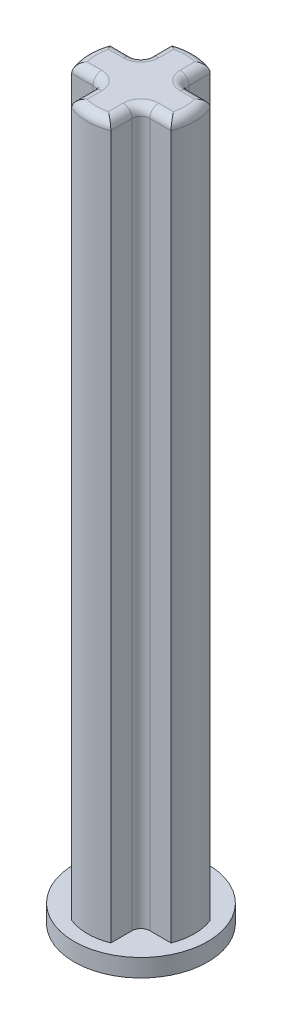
ISO-10303-21;
HEADER;
FILE_DESCRIPTION(('STEP AP214'),'2;1');
FILE_NAME('part.step','',(''),(''),'','','');
FILE_SCHEMA(('AUTOMOTIVE_DESIGN { 1 0 10303 214 1 1 1 1 }'));
ENDSEC;
DATA;
#1=APPLICATION_CONTEXT('core data for automotive mechanical design processes');
#2=APPLICATION_PROTOCOL_DEFINITION('international standard','automotive_design',2000,#1);
#3=PRODUCT_CONTEXT('',#1,'mechanical');
#4=PRODUCT('Part','Part','',(#3));
#5=PRODUCT_RELATED_PRODUCT_CATEGORY('part','',(#4));
#6=PRODUCT_DEFINITION_FORMATION('','',#4);
#7=PRODUCT_DEFINITION_CONTEXT('part definition',#1,'design');
#8=PRODUCT_DEFINITION('design','',#6,#7);
#9=PRODUCT_DEFINITION_SHAPE('','',#8);
#10=(LENGTH_UNIT() NAMED_UNIT(*) SI_UNIT(.MILLI.,.METRE.));
#11=(NAMED_UNIT(*) PLANE_ANGLE_UNIT() SI_UNIT($,.RADIAN.));
#12=(NAMED_UNIT(*) SI_UNIT($,.STERADIAN.) SOLID_ANGLE_UNIT());
#13=UNCERTAINTY_MEASURE_WITH_UNIT(LENGTH_MEASURE(1.E-05),#10,'distance_accuracy_value','');
#14=(GEOMETRIC_REPRESENTATION_CONTEXT(3) GLOBAL_UNCERTAINTY_ASSIGNED_CONTEXT((#13)) GLOBAL_UNIT_ASSIGNED_CONTEXT((#10,
#11,#12)) REPRESENTATION_CONTEXT('',''));
#15=CARTESIAN_POINT('',(0.,0.,0.));
#16=DIRECTION('',(0.,0.,1.));
#17=DIRECTION('',(1.,0.,0.));
#18=AXIS2_PLACEMENT_3D('',#15,#16,#17);
#19=CARTESIAN_POINT('',(0.880000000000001,32.,-0.88));
#20=DIRECTION('',(-1.,0.,0.));
#21=DIRECTION('',(0.,0.,1.));
#22=AXIS2_PLACEMENT_3D('',#19,#20,#21);
#23=PLANE('',#22);
#24=DIRECTION('',(0.,0.,1.));
#25=VECTOR('',#24,1.);
#26=CARTESIAN_POINT('',(0.880000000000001,31.6,-0.88));
#27=LINE('',#26,#25);
#28=CARTESIAN_POINT('',(0.880000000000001,31.6,-1.28));
#29=VERTEX_POINT('',#28);
#30=CARTESIAN_POINT('',(0.880000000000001,31.6,-2.23284571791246));
#31=VERTEX_POINT('',#30);
#32=EDGE_CURVE('E785',#29,#31,#27,.F.);
#33=ORIENTED_EDGE('',*,*,#32,.F.);
#34=DIRECTION('',(0.,1.,0.));
#35=VECTOR('',#34,1.);
#36=CARTESIAN_POINT('',(0.880000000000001,32.,-1.28));
#37=LINE('',#36,#35);
#38=CARTESIAN_POINT('',(0.880000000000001,0.,-1.28));
#39=VERTEX_POINT('',#38);
#40=EDGE_CURVE('E503',#29,#39,#37,.F.);
#41=ORIENTED_EDGE('',*,*,#40,.T.);
#42=DIRECTION('',(0.,0.,1.));
#43=VECTOR('',#42,1.);
#44=CARTESIAN_POINT('',(0.880000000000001,0.,-0.88));
#45=LINE('',#44,#43);
#46=CARTESIAN_POINT('',(0.880000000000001,0.,-2.23284571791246));
#47=VERTEX_POINT('',#46);
#48=EDGE_CURVE('E787',#47,#39,#45,.T.);
#49=ORIENTED_EDGE('',*,*,#48,.F.);
#50=DIRECTION('',(0.,1.,0.));
#51=VECTOR('',#50,1.);
#52=CARTESIAN_POINT('',(0.880000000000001,32.,-2.23284571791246));
#53=LINE('',#52,#51);
#54=EDGE_CURVE('E506',#31,#47,#53,.F.);
#55=ORIENTED_EDGE('',*,*,#54,.F.);
#56=EDGE_LOOP('',(#33,#41,#49,#55));
#57=FACE_BOUND('',#56,.T.);
#58=ADVANCED_FACE('F16',(#57),#23,.F.);
#59=CARTESIAN_POINT('',(0.,32.,0.));
#60=DIRECTION('',(0.,-1.,0.));
#61=DIRECTION('',(0.,0.,-1.));
#62=AXIS2_PLACEMENT_3D('',#59,#60,#61);
#63=CYLINDRICAL_SURFACE('',#62,2.4);
#64=CARTESIAN_POINT('',(0.,0.,0.));
#65=DIRECTION('',(0.,-1.,0.));
#66=DIRECTION('',(0.,0.,-1.));
#67=AXIS2_PLACEMENT_3D('',#64,#65,#66);
#68=CIRCLE('',#67,2.4);
#69=CARTESIAN_POINT('',(-0.88,0.,-2.23284571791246));
#70=VERTEX_POINT('',#69);
#71=EDGE_CURVE('E504',#47,#70,#68,.F.);
#72=ORIENTED_EDGE('',*,*,#71,.T.);
#73=DIRECTION('',(0.,1.,0.));
#74=VECTOR('',#73,1.);
#75=CARTESIAN_POINT('',(-0.88,32.,-2.23284571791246));
#76=LINE('',#75,#74);
#77=CARTESIAN_POINT('',(-0.88,31.6,-2.23284571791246));
#78=VERTEX_POINT('',#77);
#79=EDGE_CURVE('E767',#70,#78,#76,.T.);
#80=ORIENTED_EDGE('',*,*,#79,.T.);
#81=CARTESIAN_POINT('',(0.,31.6,0.));
#82=DIRECTION('',(0.,1.,0.));
#83=DIRECTION('',(0.,0.,1.));
#84=AXIS2_PLACEMENT_3D('',#81,#82,#83);
#85=CIRCLE('',#84,2.4);
#86=EDGE_CURVE('E622',#31,#78,#85,.T.);
#87=ORIENTED_EDGE('',*,*,#86,.F.);
#88=ORIENTED_EDGE('',*,*,#54,.T.);
#89=EDGE_LOOP('',(#72,#80,#87,#88));
#90=FACE_BOUND('',#89,.T.);
#91=ADVANCED_FACE('F801',(#90),#63,.T.);
#92=CARTESIAN_POINT('',(1.28,32.,-1.28));
#93=DIRECTION('',(0.,1.,0.));
#94=DIRECTION('',(0.,0.,1.));
#95=AXIS2_PLACEMENT_3D('',#92,#93,#94);
#96=CYLINDRICAL_SURFACE('',#95,0.4);
#97=ORIENTED_EDGE('',*,*,#40,.F.);
#98=CARTESIAN_POINT('',(1.28,31.6,-1.28));
#99=DIRECTION('',(0.,1.,0.));
#100=DIRECTION('',(0.,0.,1.));
#101=AXIS2_PLACEMENT_3D('',#98,#99,#100);
#102=CIRCLE('',#101,0.4);
#103=CARTESIAN_POINT('',(1.28,31.6,-0.88));
#104=VERTEX_POINT('',#103);
#105=EDGE_CURVE('E658',#104,#29,#102,.F.);
#106=ORIENTED_EDGE('',*,*,#105,.F.);
#107=DIRECTION('',(0.,1.,0.));
#108=VECTOR('',#107,1.);
#109=CARTESIAN_POINT('',(1.28,32.,-0.88));
#110=LINE('',#109,#108);
#111=CARTESIAN_POINT('',(1.28,0.,-0.88));
#112=VERTEX_POINT('',#111);
#113=EDGE_CURVE('E742',#104,#112,#110,.F.);
#114=ORIENTED_EDGE('',*,*,#113,.T.);
#115=CARTESIAN_POINT('',(1.28,0.,-1.28));
#116=DIRECTION('',(0.,1.,0.));
#117=DIRECTION('',(0.,0.,1.));
#118=AXIS2_PLACEMENT_3D('',#115,#116,#117);
#119=CIRCLE('',#118,0.4);
#120=EDGE_CURVE('E501',#39,#112,#119,.T.);
#121=ORIENTED_EDGE('',*,*,#120,.F.);
#122=EDGE_LOOP('',(#97,#106,#114,#121));
#123=FACE_BOUND('',#122,.T.);
#124=ADVANCED_FACE('F807',(#123),#96,.F.);
#125=CARTESIAN_POINT('',(1.28,32.,1.28));
#126=DIRECTION('',(0.,1.,0.));
#127=DIRECTION('',(0.,0.,1.));
#128=AXIS2_PLACEMENT_3D('',#125,#126,#127);
#129=CYLINDRICAL_SURFACE('',#128,0.4);
#130=DIRECTION('',(0.,1.,0.));
#131=VECTOR('',#130,1.);
#132=CARTESIAN_POINT('',(1.28,32.,0.880000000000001));
#133=LINE('',#132,#131);
#134=CARTESIAN_POINT('',(1.28,0.,0.880000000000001));
#135=VERTEX_POINT('',#134);
#136=CARTESIAN_POINT('',(1.28,31.6,0.880000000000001));
#137=VERTEX_POINT('',#136);
#138=EDGE_CURVE('E818',#135,#137,#133,.T.);
#139=ORIENTED_EDGE('',*,*,#138,.T.);
#140=CARTESIAN_POINT('',(1.28,31.6,1.28));
#141=DIRECTION('',(0.,1.,0.));
#142=DIRECTION('',(0.,0.,1.));
#143=AXIS2_PLACEMENT_3D('',#140,#141,#142);
#144=CIRCLE('',#143,0.4);
#145=CARTESIAN_POINT('',(0.880000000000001,31.6,1.28));
#146=VERTEX_POINT('',#145);
#147=EDGE_CURVE('E108',#146,#137,#144,.F.);
#148=ORIENTED_EDGE('',*,*,#147,.F.);
#149=DIRECTION('',(0.,1.,0.));
#150=VECTOR('',#149,1.);
#151=CARTESIAN_POINT('',(0.880000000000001,32.,1.28));
#152=LINE('',#151,#150);
#153=CARTESIAN_POINT('',(0.880000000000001,0.,1.28));
#154=VERTEX_POINT('',#153);
#155=EDGE_CURVE('E552',#146,#154,#152,.F.);
#156=ORIENTED_EDGE('',*,*,#155,.T.);
#157=CARTESIAN_POINT('',(1.28,0.,1.28));
#158=DIRECTION('',(0.,1.,0.));
#159=DIRECTION('',(0.,0.,1.));
#160=AXIS2_PLACEMENT_3D('',#157,#158,#159);
#161=CIRCLE('',#160,0.4);
#162=EDGE_CURVE('E499',#135,#154,#161,.T.);
#163=ORIENTED_EDGE('',*,*,#162,.F.);
#164=EDGE_LOOP('',(#139,#148,#156,#163));
#165=FACE_BOUND('',#164,.T.);
#166=ADVANCED_FACE('F950',(#165),#129,.F.);
#167=CARTESIAN_POINT('',(0.,31.6,-0.48));
#168=DIRECTION('',(1.,0.,0.));
#169=DIRECTION('',(0.,0.,-1.));
#170=AXIS2_PLACEMENT_3D('',#167,#168,#169);
#171=CYLINDRICAL_SURFACE('',#170,0.4);
#172=CARTESIAN_POINT('',(1.28,31.6,-0.48));
#173=DIRECTION('',(1.,0.,0.));
#174=DIRECTION('',(0.,0.,1.));
#175=AXIS2_PLACEMENT_3D('',#172,#173,#174);
#176=CIRCLE('',#175,0.4);
#177=CARTESIAN_POINT('',(1.28,32.,-0.48));
#178=VERTEX_POINT('',#177);
#179=EDGE_CURVE('E144',#178,#104,#176,.F.);
#180=ORIENTED_EDGE('',*,*,#179,.F.);
#181=DIRECTION('',(1.,0.,0.));
#182=VECTOR('',#181,1.);
#183=CARTESIAN_POINT('',(0.,32.,-0.48));
#184=LINE('',#183,#182);
#185=CARTESIAN_POINT('',(1.94154577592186,32.,-0.48));
#186=VERTEX_POINT('',#185);
#187=EDGE_CURVE('E311',#186,#178,#184,.F.);
#188=ORIENTED_EDGE('',*,*,#187,.F.);
#189=CARTESIAN_POINT('',(2.23284571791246,31.6,-0.88));
#190=CARTESIAN_POINT('',(2.23284573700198,31.6034696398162,-0.880000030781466));
#191=CARTESIAN_POINT('',(2.23281514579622,31.6069392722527,-0.87995445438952));
#192=CARTESIAN_POINT('',(2.23269276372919,31.6138787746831,-0.879772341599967));
#193=CARTESIAN_POINT('',(2.23260090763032,31.6173486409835,-0.879635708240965));
#194=CARTESIAN_POINT('',(2.23235584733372,31.624286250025,-0.879271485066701));
#195=CARTESIAN_POINT('',(2.23220255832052,31.6277539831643,-0.879043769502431));
#196=CARTESIAN_POINT('',(2.23183454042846,31.634684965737,-0.878497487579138));
#197=CARTESIAN_POINT('',(2.23161970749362,31.6381481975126,-0.878178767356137));
#198=CARTESIAN_POINT('',(2.23112853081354,31.6450678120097,-0.877450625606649));
#199=CARTESIAN_POINT('',(2.23085206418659,31.6485241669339,-0.877041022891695));
#200=CARTESIAN_POINT('',(2.23023757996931,31.6554276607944,-0.876131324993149));
#201=CARTESIAN_POINT('',(2.22989942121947,31.6588747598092,-0.875631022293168));
#202=CARTESIAN_POINT('',(2.22916154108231,31.6657573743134,-0.874540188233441));
#203=CARTESIAN_POINT('',(2.2287616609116,31.6691928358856,-0.873949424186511));
#204=CARTESIAN_POINT('',(2.2279003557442,31.6760498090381,-0.872677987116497));
#205=CARTESIAN_POINT('',(2.2274387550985,31.6794712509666,-0.871997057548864));
#206=CARTESIAN_POINT('',(2.22645405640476,31.6862978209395,-0.870545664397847));
#207=CARTESIAN_POINT('',(2.22593076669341,31.6897028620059,-0.869774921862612));
#208=CARTESIAN_POINT('',(2.22482276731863,31.6964942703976,-0.868144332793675));
#209=CARTESIAN_POINT('',(2.22423785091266,31.6998805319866,-0.867284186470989));
#210=CARTESIAN_POINT('',(2.2230067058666,31.7066320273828,-0.865475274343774));
#211=CARTESIAN_POINT('',(2.22236025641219,31.7099971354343,-0.864526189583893));
#212=CARTESIAN_POINT('',(2.2210061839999,31.7167039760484,-0.862539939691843));
#213=CARTESIAN_POINT('',(2.22029832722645,31.7200455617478,-0.861502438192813));
#214=CARTESIAN_POINT('',(2.21882160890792,31.7267030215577,-0.859339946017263));
#215=CARTESIAN_POINT('',(2.21805250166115,31.7300187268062,-0.858214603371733));
#216=CARTESIAN_POINT('',(2.21645348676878,31.7366220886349,-0.855877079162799));
#217=CARTESIAN_POINT('',(2.21562332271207,31.739909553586,-0.854664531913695));
#218=CARTESIAN_POINT('',(2.21390241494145,31.7464541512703,-0.852153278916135));
#219=CARTESIAN_POINT('',(2.21301140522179,31.749711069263,-0.85085419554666));
#220=CARTESIAN_POINT('',(2.21116911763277,31.7561921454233,-0.84817068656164));
#221=CARTESIAN_POINT('',(2.21021756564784,31.7594160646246,-0.846785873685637));
#222=CARTESIAN_POINT('',(2.20726520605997,31.7690604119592,-0.84249336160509));
#223=CARTESIAN_POINT('',(2.20517998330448,31.7754029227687,-0.839466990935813));
#224=CARTESIAN_POINT('',(2.2007735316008,31.7879305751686,-0.833084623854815));
#225=CARTESIAN_POINT('',(2.19844996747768,31.7941132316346,-0.829725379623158));
#226=CARTESIAN_POINT('',(2.19357004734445,31.8063041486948,-0.82268486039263));
#227=CARTESIAN_POINT('',(2.19101130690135,31.812309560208,-0.819000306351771));
#228=CARTESIAN_POINT('',(2.18566498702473,31.8241285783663,-0.811317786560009));
#229=CARTESIAN_POINT('',(2.18287501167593,31.8299389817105,-0.807316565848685));
#230=CARTESIAN_POINT('',(2.17707070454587,31.8413511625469,-0.799009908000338));
#231=CARTESIAN_POINT('',(2.17405399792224,31.8469494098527,-0.794701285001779));
#232=CARTESIAN_POINT('',(2.16780118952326,31.8579209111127,-0.785789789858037));
#233=CARTESIAN_POINT('',(2.16456276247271,31.8632903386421,-0.781183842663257));
#234=CARTESIAN_POINT('',(2.15787246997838,31.8737881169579,-0.771687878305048));
#235=CARTESIAN_POINT('',(2.15441836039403,31.8789123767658,-0.766794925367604));
#236=CARTESIAN_POINT('',(2.14730168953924,31.888905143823,-0.756737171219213));
#237=CARTESIAN_POINT('',(2.14363696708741,31.8937693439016,-0.751569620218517));
#238=CARTESIAN_POINT('',(2.13693730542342,31.9021860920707,-0.74213400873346));
#239=CARTESIAN_POINT('',(2.13392969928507,31.9058011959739,-0.737902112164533));
#240=CARTESIAN_POINT('',(2.1277624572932,31.9128972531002,-0.729231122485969));
#241=CARTESIAN_POINT('',(2.1246009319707,31.9163734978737,-0.724789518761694));
#242=CARTESIAN_POINT('',(2.11812354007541,31.9231793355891,-0.715705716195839));
#243=CARTESIAN_POINT('',(2.11480581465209,31.9265041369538,-0.711061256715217));
#244=CARTESIAN_POINT('',(2.10801539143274,31.9329939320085,-0.701577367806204));
#245=CARTESIAN_POINT('',(2.10454089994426,31.9361540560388,-0.696735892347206));
#246=CARTESIAN_POINT('',(2.09743666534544,31.9423013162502,-0.686864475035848));
#247=CARTESIAN_POINT('',(2.09380519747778,31.9452835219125,-0.681832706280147));
#248=CARTESIAN_POINT('',(2.08638751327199,31.9510616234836,-0.671587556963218));
#249=CARTESIAN_POINT('',(2.08259965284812,31.9538525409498,-0.666372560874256));
#250=CARTESIAN_POINT('',(2.07487041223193,31.9592346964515,-0.655768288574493));
#251=CARTESIAN_POINT('',(2.07092747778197,31.9618209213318,-0.650377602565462));
#252=CARTESIAN_POINT('',(2.06289012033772,31.9667803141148,-0.639429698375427));
#253=CARTESIAN_POINT('',(2.05879424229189,31.969148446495,-0.633871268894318));
#254=CARTESIAN_POINT('',(2.05045386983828,31.9736583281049,-0.622596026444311));
#255=CARTESIAN_POINT('',(2.04620802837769,31.9757950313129,-0.616878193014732));
#256=CARTESIAN_POINT('',(2.03757148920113,31.9798288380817,-0.605292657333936));
#257=CARTESIAN_POINT('',(2.03317956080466,31.9817208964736,-0.599424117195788));
#258=CARTESIAN_POINT('',(2.02425553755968,31.9852523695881,-0.587546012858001));
#259=CARTESIAN_POINT('',(2.019722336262,31.9868867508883,-0.581535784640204));
#260=CARTESIAN_POINT('',(2.01052142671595,31.9898900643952,-0.569383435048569));
#261=CARTESIAN_POINT('',(2.00585274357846,31.9912539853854,-0.563240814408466));
#262=CARTESIAN_POINT('',(1.99638753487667,31.9937038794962,-0.550833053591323));
#263=CARTESIAN_POINT('',(1.99159017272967,31.9947848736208,-0.544567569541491));
#264=CARTESIAN_POINT('',(1.98187531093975,31.9966567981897,-0.531923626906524));
#265=CARTESIAN_POINT('',(1.97695711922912,31.9974427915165,-0.525544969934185));
#266=CARTESIAN_POINT('',(1.96700935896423,31.9987130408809,-0.51268440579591));
#267=CARTESIAN_POINT('',(1.96197924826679,31.9991924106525,-0.506202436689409));
#268=CARTESIAN_POINT('',(1.95181753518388,31.9998383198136,-0.493144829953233));
#269=CARTESIAN_POINT('',(1.94668554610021,32.0000000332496,-0.486569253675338));
#270=CARTESIAN_POINT('',(1.94154577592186,32.,-0.48));
#271=B_SPLINE_CURVE_WITH_KNOTS('',3,(#189,#190,#191,#192,#193,#194,#195,#196,#197,#198,#199,
#200,#201,#202,#203,#204,#205,#206,#207,#208,#209,#210,#211,#212,#213,#214,#215,#216,#217,#218,
#219,#220,#221,#222,#223,#224,#225,#226,#227,#228,#229,#230,#231,#232,#233,#234,#235,#236,#237,
#238,#239,#240,#241,#242,#243,#244,#245,#246,#247,#248,#249,#250,#251,#252,#253,#254,#255,#256,
#257,#258,#259,#260,#261,#262,#263,#264,#265,#266,#267,#268,#269,#270),.UNSPECIFIED.,.F.,.F.,(4,
2,2,2,2,2,2,2,2,2,2,2,2,2,2,2,2,2,2,2,2,2,2,2,2,2,2,2,2,2,2,2,2,2,2,2,2,2,2,2,4),(0.,
0.0104084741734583,0.0208280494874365,0.0312620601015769,0.0417138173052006,0.0521866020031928,
0.0626836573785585,0.0732081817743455,0.0837633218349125,0.0943521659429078,0.104977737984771,
0.115642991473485,0.126350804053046,0.137103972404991,0.147905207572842,0.158757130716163,
0.169662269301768,0.191639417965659,0.213857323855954,0.236332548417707,0.259079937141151,
0.282112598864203,0.305441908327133,0.3290775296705,0.353027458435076,0.37200176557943,
0.391393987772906,0.411205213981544,0.431435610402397,0.45208448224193,0.473150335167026,
0.494630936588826,0.516523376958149,0.538824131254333,0.561529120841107,0.584633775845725,
0.608133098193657,0.632021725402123,0.656293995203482,0.680944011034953,0.705965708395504),.UNSPECIFIED.);
#272=CARTESIAN_POINT('',(2.23284571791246,31.6,-0.88));
#273=VERTEX_POINT('',#272);
#274=EDGE_CURVE('E152',#273,#186,#271,.T.);
#275=ORIENTED_EDGE('',*,*,#274,.F.);
#276=DIRECTION('',(1.,0.,0.));
#277=VECTOR('',#276,1.);
#278=CARTESIAN_POINT('',(0.880000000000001,31.6,-0.88));
#279=LINE('',#278,#277);
#280=EDGE_CURVE('E739',#273,#104,#279,.F.);
#281=ORIENTED_EDGE('',*,*,#280,.T.);
#282=EDGE_LOOP('',(#180,#188,#275,#281));
#283=FACE_BOUND('',#282,.T.);
#284=ADVANCED_FACE('F668',(#283),#171,.T.);
#285=CARTESIAN_POINT('',(1.28,31.6,-1.28));
#286=DIRECTION('',(0.,1.,0.));
#287=DIRECTION('',(0.,0.,1.));
#288=AXIS2_PLACEMENT_3D('',#285,#286,#287);
#289=TOROIDAL_SURFACE('',#288,0.8,0.4);
#290=CARTESIAN_POINT('',(0.480000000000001,31.6,-1.28));
#291=DIRECTION('',(0.,0.,1.));
#292=DIRECTION('',(1.,0.,0.));
#293=AXIS2_PLACEMENT_3D('',#290,#291,#292);
#294=CIRCLE('',#293,0.4);
#295=CARTESIAN_POINT('',(0.480000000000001,32.,-1.28));
#296=VERTEX_POINT('',#295);
#297=EDGE_CURVE('E650',#296,#29,#294,.F.);
#298=ORIENTED_EDGE('',*,*,#297,.F.);
#299=CARTESIAN_POINT('',(1.28,32.,-1.28));
#300=DIRECTION('',(0.,1.,0.));
#301=DIRECTION('',(-1.,0.,0.));
#302=AXIS2_PLACEMENT_3D('',#299,#300,#301);
#303=CIRCLE('',#302,0.8);
#304=EDGE_CURVE('E308',#178,#296,#303,.F.);
#305=ORIENTED_EDGE('',*,*,#304,.F.);
#306=ORIENTED_EDGE('',*,*,#179,.T.);
#307=ORIENTED_EDGE('',*,*,#105,.T.);
#308=EDGE_LOOP('',(#298,#305,#306,#307));
#309=FACE_BOUND('',#308,.T.);
#310=ADVANCED_FACE('F664',(#309),#289,.T.);
#311=CARTESIAN_POINT('',(0.480000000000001,31.6,0.));
#312=DIRECTION('',(0.,0.,1.));
#313=DIRECTION('',(1.,0.,0.));
#314=AXIS2_PLACEMENT_3D('',#311,#312,#313);
#315=CYLINDRICAL_SURFACE('',#314,0.4);
#316=CARTESIAN_POINT('',(0.48,32.,-1.94154577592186));
#317=CARTESIAN_POINT('',(0.486567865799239,32.000000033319,-1.94668445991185));
#318=CARTESIAN_POINT('',(0.493142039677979,31.9998383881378,-1.95181538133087));
#319=CARTESIAN_POINT('',(0.506196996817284,31.9991927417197,-1.96197513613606));
#320=CARTESIAN_POINT('',(0.512677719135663,31.9987135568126,-1.96700435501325));
#321=CARTESIAN_POINT('',(0.525535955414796,31.9974437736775,-1.97695050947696));
#322=CARTESIAN_POINT('',(0.531913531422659,31.9966580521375,-1.98186798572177));
#323=CARTESIAN_POINT('',(0.544555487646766,31.9947867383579,-1.99158159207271));
#324=CARTESIAN_POINT('',(0.550820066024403,31.9937060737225,-1.99637841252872));
#325=CARTESIAN_POINT('',(0.563226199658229,31.9912568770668,-2.00584270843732));
#326=CARTESIAN_POINT('',(0.569368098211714,31.9898933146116,-2.01051101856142));
#327=CARTESIAN_POINT('',(0.581519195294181,31.9868907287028,-2.01971134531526));
#328=CARTESIAN_POINT('',(0.587528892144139,31.9852567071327,-2.0242443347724));
#329=CARTESIAN_POINT('',(0.59940613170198,31.9817259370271,-2.03316808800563));
#330=CARTESIAN_POINT('',(0.605274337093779,31.9798342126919,-2.03755995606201));
#331=CARTESIAN_POINT('',(0.61685940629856,31.9758010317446,-2.04619651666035));
#332=CARTESIAN_POINT('',(0.622577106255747,31.9736646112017,-2.05044243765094));
#333=CARTESIAN_POINT('',(0.63385228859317,31.9691552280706,-2.05878309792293));
#334=CARTESIAN_POINT('',(0.639410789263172,31.9667873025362,-2.06287918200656));
#335=CARTESIAN_POINT('',(0.650359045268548,31.9618282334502,-2.07091706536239));
#336=CARTESIAN_POINT('',(0.655750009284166,31.9592421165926,-2.07486031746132));
#337=CARTESIAN_POINT('',(0.666355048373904,31.9538600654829,-2.08259029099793));
#338=CARTESIAN_POINT('',(0.671570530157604,31.9510691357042,-2.08637856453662));
#339=CARTESIAN_POINT('',(0.681816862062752,31.9452908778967,-2.0937971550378));
#340=CARTESIAN_POINT('',(0.686849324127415,31.9423085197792,-2.09742911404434));
#341=CARTESIAN_POINT('',(0.696722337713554,31.9361608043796,-2.10453439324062));
#342=CARTESIAN_POINT('',(0.701564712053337,31.9330003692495,-2.10800943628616));
#343=CARTESIAN_POINT('',(0.711050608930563,31.9265097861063,-2.11480100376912));
#344=CARTESIAN_POINT('',(0.715696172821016,31.923184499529,-2.11811932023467));
#345=CARTESIAN_POINT('',(0.72478238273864,31.9163775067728,-2.12459792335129));
#346=CARTESIAN_POINT('',(0.729225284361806,31.9129005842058,-2.12776006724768));
#347=CARTESIAN_POINT('',(0.737899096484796,31.9058029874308,-2.13392852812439));
#348=CARTESIAN_POINT('',(0.742132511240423,31.9021870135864,-2.13693673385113));
#349=CARTESIAN_POINT('',(0.751569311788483,31.8937701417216,-2.14363612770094));
#350=CARTESIAN_POINT('',(0.756736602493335,31.8889067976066,-2.14730002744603));
#351=CARTESIAN_POINT('',(0.766793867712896,31.8789157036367,-2.15441527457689));
#352=CARTESIAN_POINT('',(0.771686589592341,31.8737922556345,-2.15786877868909));
#353=CARTESIAN_POINT('',(0.781182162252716,31.8632960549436,-2.16455803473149));
#354=CARTESIAN_POINT('',(0.785787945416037,31.8579273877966,-2.16779602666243));
#355=CARTESIAN_POINT('',(0.794699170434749,31.8469573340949,-2.17404813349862));
#356=CARTESIAN_POINT('',(0.799007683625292,31.841359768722,-2.17706456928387));
#357=CARTESIAN_POINT('',(0.8073141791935,31.8299488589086,-2.1828684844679));
#358=CARTESIAN_POINT('',(0.811315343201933,31.8241390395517,-2.18565833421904));
#359=CARTESIAN_POINT('',(0.818997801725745,31.8123210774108,-2.19100453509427));
#360=CARTESIAN_POINT('',(0.822682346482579,31.8063161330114,-2.19356327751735));
#361=CARTESIAN_POINT('',(0.829722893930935,31.794126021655,-2.19844331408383));
#362=CARTESIAN_POINT('',(0.833082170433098,31.7879436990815,-2.20076698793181));
#363=CARTESIAN_POINT('',(0.83946464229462,31.7754165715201,-2.20517375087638));
#364=CARTESIAN_POINT('',(0.84249107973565,31.769074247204,-2.20725917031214));
#365=CARTESIAN_POINT('',(0.846783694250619,31.7594301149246,-2.21021186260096));
#366=CARTESIAN_POINT('',(0.848168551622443,31.7562062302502,-2.21116353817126));
#367=CARTESIAN_POINT('',(0.850852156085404,31.7497251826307,-2.21300608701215));
#368=CARTESIAN_POINT('',(0.852151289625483,31.7464682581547,-2.21389723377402));
#369=CARTESIAN_POINT('',(0.854662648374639,31.7399236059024,-2.21561842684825));
#370=CARTESIAN_POINT('',(0.855875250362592,31.7366360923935,-2.21644873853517));
#371=CARTESIAN_POINT('',(0.858212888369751,31.7300325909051,-2.21804805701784));
#372=CARTESIAN_POINT('',(0.859338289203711,31.7267167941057,-2.21881731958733));
#373=CARTESIAN_POINT('',(0.861500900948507,31.7200591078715,-2.22029435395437));
#374=CARTESIAN_POINT('',(0.862538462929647,31.716717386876,-2.22100237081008));
#375=CARTESIAN_POINT('',(0.864524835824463,31.7100102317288,-2.22235676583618));
#376=CARTESIAN_POINT('',(0.865473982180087,31.7066449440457,-2.22300337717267));
#377=CARTESIAN_POINT('',(0.867283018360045,31.6998930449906,-2.22423484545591));
#378=CARTESIAN_POINT('',(0.868143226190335,31.6965065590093,-2.22481992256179));
#379=CARTESIAN_POINT('',(0.869773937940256,31.6897146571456,-2.22592823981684));
#380=CARTESIAN_POINT('',(0.870544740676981,31.6863093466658,-2.22645168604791));
#381=CARTESIAN_POINT('',(0.871996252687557,31.6794821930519,-2.22743669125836));
#382=CARTESIAN_POINT('',(0.872677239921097,31.6760604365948,-2.22789844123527));
#383=CARTESIAN_POINT('',(0.873948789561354,31.6692027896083,-2.2287600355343));
#384=CARTESIAN_POINT('',(0.87453960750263,31.6657669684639,-2.22916005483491));
#385=CARTESIAN_POINT('',(0.875630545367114,31.658883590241,-2.22989820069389));
#386=CARTESIAN_POINT('',(0.876130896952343,31.6554360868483,-2.23023648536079));
#387=CARTESIAN_POINT('',(0.877040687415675,31.6485317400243,-2.23085120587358));
#388=CARTESIAN_POINT('',(0.877450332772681,31.6450749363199,-2.23112778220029));
#389=CARTESIAN_POINT('',(0.87817855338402,31.6381543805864,-2.23161915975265));
#390=CARTESIAN_POINT('',(0.878497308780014,31.6346906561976,-2.23183408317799));
#391=CARTESIAN_POINT('',(0.879043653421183,31.627758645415,-2.23220226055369));
#392=CARTESIAN_POINT('',(0.879271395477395,31.6242903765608,-2.23235561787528));
#393=CARTESIAN_POINT('',(0.879635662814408,31.6173516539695,-2.23260079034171));
#394=CARTESIAN_POINT('',(0.879772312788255,31.6138812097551,-2.23269268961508));
#395=CARTESIAN_POINT('',(0.879954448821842,31.6069405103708,-2.23281513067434));
#396=CARTESIAN_POINT('',(0.880000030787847,31.6034702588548,-2.23284573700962));
#397=CARTESIAN_POINT('',(0.88,31.6,-2.23284571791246));
#398=B_SPLINE_CURVE_WITH_KNOTS('',3,(#316,#317,#318,#319,#320,#321,#322,#323,#324,#325,#326,
#327,#328,#329,#330,#331,#332,#333,#334,#335,#336,#337,#338,#339,#340,#341,#342,#343,#344,#345,
#346,#347,#348,#349,#350,#351,#352,#353,#354,#355,#356,#357,#358,#359,#360,#361,#362,#363,#364,
#365,#366,#367,#368,#369,#370,#371,#372,#373,#374,#375,#376,#377,#378,#379,#380,#381,#382,#383,
#384,#385,#386,#387,#388,#389,#390,#391,#392,#393,#394,#395,#396,#397),.UNSPECIFIED.,.F.,.F.,(4,
2,2,2,2,2,2,2,2,2,2,2,2,2,2,2,2,2,2,2,2,2,2,2,2,2,2,2,2,2,2,2,2,2,2,2,2,2,2,2,4),(0.,
0.0250164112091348,0.0496618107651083,0.0739301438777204,0.097815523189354,0.121312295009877,
0.144415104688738,0.167118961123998,0.189419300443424,0.211312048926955,0.232793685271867,
0.253861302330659,0.274512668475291,0.294746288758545,0.314561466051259,0.333958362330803,
0.352938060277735,0.376884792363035,0.400517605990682,0.423844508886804,0.4468751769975,
0.469620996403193,0.49209508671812,0.514312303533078,0.536289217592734,0.547194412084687,
0.558046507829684,0.568848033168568,0.579601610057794,0.590309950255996,0.600975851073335,
0.611602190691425,0.622191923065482,0.632748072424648,0.643273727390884,0.653772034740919,
0.664246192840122,0.674699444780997,0.685135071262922,0.695556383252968,0.705966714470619),.UNSPECIFIED.);
#399=CARTESIAN_POINT('',(0.48,32.,-1.94154577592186));
#400=VERTEX_POINT('',#399);
#401=EDGE_CURVE('E629',#400,#31,#398,.T.);
#402=ORIENTED_EDGE('',*,*,#401,.F.);
#403=DIRECTION('',(0.,0.,1.));
#404=VECTOR('',#403,1.);
#405=CARTESIAN_POINT('',(0.480000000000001,32.,0.));
#406=LINE('',#405,#404);
#407=EDGE_CURVE('E305',#296,#400,#406,.F.);
#408=ORIENTED_EDGE('',*,*,#407,.F.);
#409=ORIENTED_EDGE('',*,*,#297,.T.);
#410=ORIENTED_EDGE('',*,*,#32,.T.);
#411=EDGE_LOOP('',(#402,#408,#409,#410));
#412=FACE_BOUND('',#411,.T.);
#413=ADVANCED_FACE('F607',(#412),#315,.T.);
#414=CARTESIAN_POINT('',(0.,31.6,0.));
#415=DIRECTION('',(0.,1.,0.));
#416=DIRECTION('',(0.,0.,1.));
#417=AXIS2_PLACEMENT_3D('',#414,#415,#416);
#418=TOROIDAL_SURFACE('',#417,2.,0.4);
#419=CARTESIAN_POINT('',(-0.879999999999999,31.6,-2.23284571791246));
#420=CARTESIAN_POINT('',(-0.880000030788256,31.6034698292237,-2.23284573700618));
#421=CARTESIAN_POINT('',(-0.879954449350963,31.6069396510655,-2.23281514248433));
#422=CARTESIAN_POINT('',(-0.87977231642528,31.6138795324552,-2.23269274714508));
#423=CARTESIAN_POINT('',(-0.879635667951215,31.6173495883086,-2.23260088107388));
#424=CARTESIAN_POINT('',(-0.879271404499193,31.6242875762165,-2.23235579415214));
#425=CARTESIAN_POINT('',(-0.879043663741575,31.6277554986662,-2.23220248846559));
#426=CARTESIAN_POINT('',(-0.878497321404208,31.6346868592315,-2.23183443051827));
#427=CARTESIAN_POINT('',(-0.878178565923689,31.6381502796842,-2.23161957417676));
#428=CARTESIAN_POINT('',(-0.877450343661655,31.6450702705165,-2.23112834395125));
#429=CARTESIAN_POINT('',(-0.877040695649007,31.648526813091,-2.2308518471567));
#430=CARTESIAN_POINT('',(-0.876130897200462,31.655430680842,-2.23023729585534));
#431=CARTESIAN_POINT('',(-0.875630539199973,31.6588779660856,-2.2298991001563));
#432=CARTESIAN_POINT('',(-0.874539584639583,31.6657609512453,-2.22916113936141));
#433=CARTESIAN_POINT('',(-0.873948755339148,31.6691965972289,-2.22876121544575));
#434=CARTESIAN_POINT('',(-0.872677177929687,31.6760539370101,-2.22789981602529));
#435=CARTESIAN_POINT('',(-0.871996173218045,31.6794755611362,-2.22743816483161));
#436=CARTESIAN_POINT('',(-0.870544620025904,31.6863024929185,-2.22645335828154));
#437=CARTESIAN_POINT('',(-0.869773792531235,31.6897077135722,-2.22593001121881));
#438=CARTESIAN_POINT('',(-0.86814302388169,31.6964994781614,-2.22482189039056));
#439=CARTESIAN_POINT('',(-0.867282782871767,31.6998859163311,-2.22423690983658));
#440=CARTESIAN_POINT('',(-0.865473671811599,31.7066377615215,-2.22300562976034));
#441=CARTESIAN_POINT('',(-0.864524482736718,31.7100030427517,-2.22235910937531));
#442=CARTESIAN_POINT('',(-0.862538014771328,31.7167102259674,-2.2210048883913));
#443=CARTESIAN_POINT('',(-0.861500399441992,31.7200519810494,-2.22029695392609));
#444=CARTESIAN_POINT('',(-0.85933767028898,31.7267097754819,-2.2188200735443));
#445=CARTESIAN_POINT('',(-0.858212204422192,31.7300256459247,-2.21805088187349));
#446=CARTESIAN_POINT('',(-0.85587442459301,31.7366293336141,-2.21645169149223));
#447=CARTESIAN_POINT('',(-0.854661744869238,31.73991695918,-2.21562143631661));
#448=CARTESIAN_POINT('',(-0.852150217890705,31.7464618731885,-2.21390033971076));
#449=CARTESIAN_POINT('',(-0.850850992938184,31.7497189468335,-2.21300923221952));
#450=CARTESIAN_POINT('',(-0.848167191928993,31.7562003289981,-2.21116674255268));
#451=CARTESIAN_POINT('',(-0.846782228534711,31.7594243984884,-2.21021508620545));
#452=CARTESIAN_POINT('',(-0.842489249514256,31.7690691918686,-2.20726240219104));
#453=CARTESIAN_POINT('',(-0.839462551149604,31.775411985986,-2.20517695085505));
#454=CARTESIAN_POINT('',(-0.833079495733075,31.7879401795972,-2.20077001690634));
#455=CARTESIAN_POINT('',(-0.829719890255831,31.7941230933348,-2.19844619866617));
#456=CARTESIAN_POINT('',(-0.822678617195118,31.8063144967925,-2.19356574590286));
#457=CARTESIAN_POINT('',(-0.818993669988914,31.8123201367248,-2.19100672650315));
#458=CARTESIAN_POINT('',(-0.81131033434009,31.8241395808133,-2.18565982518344));
#459=CARTESIAN_POINT('',(-0.807308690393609,31.8299501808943,-2.18286954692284));
#460=CARTESIAN_POINT('',(-0.799001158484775,31.8413627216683,-2.17706461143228));
#461=CARTESIAN_POINT('',(-0.794692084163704,31.8469611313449,-2.17404757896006));
#462=CARTESIAN_POINT('',(-0.785779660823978,31.85793292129,-2.16779409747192));
#463=CARTESIAN_POINT('',(-0.781173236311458,31.8633024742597,-2.1645553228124));
#464=CARTESIAN_POINT('',(-0.771676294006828,31.8738004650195,-2.15786431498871));
#465=CARTESIAN_POINT('',(-0.766782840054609,31.8789248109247,-2.15440983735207));
#466=CARTESIAN_POINT('',(-0.756724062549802,31.8889177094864,-2.1472924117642));
#467=CARTESIAN_POINT('',(-0.751555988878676,31.8937819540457,-2.14362730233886));
#468=CARTESIAN_POINT('',(-0.742119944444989,31.9021982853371,-2.13692730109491));
#469=CARTESIAN_POINT('',(-0.737888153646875,31.9058129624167,-2.13391975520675));
#470=CARTESIAN_POINT('',(-0.729217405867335,31.9129081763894,-2.12775265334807));
#471=CARTESIAN_POINT('',(-0.724775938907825,31.9163840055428,-2.12459120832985));
#472=CARTESIAN_POINT('',(-0.715692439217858,31.9231890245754,-2.11811399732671));
#473=CARTESIAN_POINT('',(-0.711048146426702,31.9265134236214,-2.11479637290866));
#474=CARTESIAN_POINT('',(-0.701564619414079,31.9330024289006,-2.10800617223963));
#475=CARTESIAN_POINT('',(-0.696723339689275,31.9361621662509,-2.10453180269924));
#476=CARTESIAN_POINT('',(-0.686852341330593,31.9423086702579,-2.09742783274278));
#477=CARTESIAN_POINT('',(-0.681820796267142,31.9452905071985,-2.09379650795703));
#478=CARTESIAN_POINT('',(-0.671576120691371,31.951067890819,-2.08637913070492));
#479=CARTESIAN_POINT('',(-0.666361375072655,31.9538584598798,-2.08259143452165));
#480=CARTESIAN_POINT('',(-0.655757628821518,31.9592399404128,-2.07486254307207));
#481=CARTESIAN_POINT('',(-0.650367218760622,31.9618258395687,-2.07091979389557));
#482=CARTESIAN_POINT('',(-0.639419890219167,31.966784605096,-2.06288282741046));
#483=CARTESIAN_POINT('',(-0.633861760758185,31.9691524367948,-2.05878715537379));
#484=CARTESIAN_POINT('',(-0.622587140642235,31.9736617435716,-2.05044721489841));
#485=CARTESIAN_POINT('',(-0.616869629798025,31.9757981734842,-2.04620159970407));
#486=CARTESIAN_POINT('',(-0.605284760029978,31.9798314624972,-2.03756553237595));
#487=CARTESIAN_POINT('',(-0.59941656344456,31.9817232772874,-2.03317384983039));
#488=CARTESIAN_POINT('',(-0.587539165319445,31.9852542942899,-2.0242503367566));
#489=CARTESIAN_POINT('',(-0.581529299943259,31.9868884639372,-2.01971740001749));
#490=CARTESIAN_POINT('',(-0.569377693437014,31.9898913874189,-2.01051703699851));
#491=CARTESIAN_POINT('',(-0.563235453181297,31.9912551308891,-2.00584863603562));
#492=CARTESIAN_POINT('',(-0.55082846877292,31.9937047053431,-1.9963840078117));
#493=CARTESIAN_POINT('',(-0.544563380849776,31.994785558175,-1.99158694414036));
#494=CARTESIAN_POINT('',(-0.531920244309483,31.9966572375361,-1.98187269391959));
#495=CARTESIAN_POINT('',(-0.525541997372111,31.9974431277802,-1.97695481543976));
#496=CARTESIAN_POINT('',(-0.512682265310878,31.9987132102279,-1.96700769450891));
#497=CARTESIAN_POINT('',(-0.506200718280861,31.9991925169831,-1.9619779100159));
#498=CARTESIAN_POINT('',(-0.493143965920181,31.9998383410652,-1.9518168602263));
#499=CARTESIAN_POINT('',(-0.486568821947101,32.0000000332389,-1.94668520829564));
#500=CARTESIAN_POINT('',(-0.48,32.,-1.94154577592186));
#501=B_SPLINE_CURVE_WITH_KNOTS('',3,(#419,#420,#421,#422,#423,#424,#425,#426,#427,#428,#429,
#430,#431,#432,#433,#434,#435,#436,#437,#438,#439,#440,#441,#442,#443,#444,#445,#446,#447,#448,
#449,#450,#451,#452,#453,#454,#455,#456,#457,#458,#459,#460,#461,#462,#463,#464,#465,#466,#467,
#468,#469,#470,#471,#472,#473,#474,#475,#476,#477,#478,#479,#480,#481,#482,#483,#484,#485,#486,
#487,#488,#489,#490,#491,#492,#493,#494,#495,#496,#497,#498,#499,#500),.UNSPECIFIED.,.F.,.F.,(4,
2,2,2,2,2,2,2,2,2,2,2,2,2,2,2,2,2,2,2,2,2,2,2,2,2,2,2,2,2,2,2,2,2,2,2,2,2,2,2,4),(0.,
0.0104090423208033,0.0208291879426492,0.0312637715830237,0.0417161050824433,0.0521894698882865,
0.0626871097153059,0.0732122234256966,0.0837679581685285,0.0943574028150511,0.104983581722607,
0.115649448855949,0.126357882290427,0.137111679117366,0.147913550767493,0.158766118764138,
0.169671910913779,0.19165039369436,0.213869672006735,0.236346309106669,0.259095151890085,
0.282129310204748,0.305460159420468,0.329097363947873,0.353048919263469,0.372022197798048,
0.39141335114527,0.411223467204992,0.431452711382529,0.452100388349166,0.47316500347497,
0.49464432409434,0.51653544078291,0.538834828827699,0.561538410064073,0.584641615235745,
0.608139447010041,0.632026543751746,0.656297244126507,0.680945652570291,0.705965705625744),.UNSPECIFIED.);
#502=CARTESIAN_POINT('',(-0.48,32.,-1.94154577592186));
#503=VERTEX_POINT('',#502);
#504=EDGE_CURVE('E581',#503,#78,#501,.F.);
#505=ORIENTED_EDGE('',*,*,#504,.F.);
#506=CARTESIAN_POINT('',(0.,32.,0.));
#507=DIRECTION('',(0.,-1.,0.));
#508=DIRECTION('',(-0.239999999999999,0.,-0.970772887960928));
#509=AXIS2_PLACEMENT_3D('',#506,#507,#508);
#510=CIRCLE('',#509,2.);
#511=EDGE_CURVE('E302',#400,#503,#510,.F.);
#512=ORIENTED_EDGE('',*,*,#511,.F.);
#513=ORIENTED_EDGE('',*,*,#401,.T.);
#514=ORIENTED_EDGE('',*,*,#86,.T.);
#515=EDGE_LOOP('',(#505,#512,#513,#514));
#516=FACE_BOUND('',#515,.T.);
#517=ADVANCED_FACE('F600',(#516),#418,.T.);
#518=CARTESIAN_POINT('',(-0.48,31.6,0.));
#519=DIRECTION('',(0.,0.,-1.));
#520=DIRECTION('',(-1.,0.,0.));
#521=AXIS2_PLACEMENT_3D('',#518,#519,#520);
#522=CYLINDRICAL_SURFACE('',#521,0.4);
#523=ORIENTED_EDGE('',*,*,#504,.T.);
#524=DIRECTION('',(0.,0.,-1.));
#525=VECTOR('',#524,1.);
#526=CARTESIAN_POINT('',(-0.88,31.6,-2.23284571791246));
#527=LINE('',#526,#525);
#528=CARTESIAN_POINT('',(-0.88,31.6,-1.28));
#529=VERTEX_POINT('',#528);
#530=EDGE_CURVE('E770',#78,#529,#527,.F.);
#531=ORIENTED_EDGE('',*,*,#530,.T.);
#532=CARTESIAN_POINT('',(-0.48,31.6,-1.28));
#533=DIRECTION('',(0.,0.,-1.));
#534=DIRECTION('',(1.,0.,0.));
#535=AXIS2_PLACEMENT_3D('',#532,#533,#534);
#536=CIRCLE('',#535,0.4);
#537=CARTESIAN_POINT('',(-0.48,32.,-1.28));
#538=VERTEX_POINT('',#537);
#539=EDGE_CURVE('E549',#538,#529,#536,.F.);
#540=ORIENTED_EDGE('',*,*,#539,.F.);
#541=DIRECTION('',(0.,0.,1.));
#542=VECTOR('',#541,1.);
#543=CARTESIAN_POINT('',(-0.48,32.,0.));
#544=LINE('',#543,#542);
#545=EDGE_CURVE('E299',#503,#538,#544,.T.);
#546=ORIENTED_EDGE('',*,*,#545,.F.);
#547=EDGE_LOOP('',(#523,#531,#540,#546));
#548=FACE_BOUND('',#547,.T.);
#549=ADVANCED_FACE('F589',(#548),#522,.T.);
#550=CARTESIAN_POINT('',(-1.28,31.6,1.28));
#551=DIRECTION('',(0.,1.,0.));
#552=DIRECTION('',(0.,0.,1.));
#553=AXIS2_PLACEMENT_3D('',#550,#551,#552);
#554=TOROIDAL_SURFACE('',#553,0.8,0.4);
#555=CARTESIAN_POINT('',(-1.28,31.6,0.480000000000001));
#556=DIRECTION('',(-1.,0.,0.));
#557=DIRECTION('',(0.,0.,1.));
#558=AXIS2_PLACEMENT_3D('',#555,#556,#557);
#559=CIRCLE('',#558,0.4);
#560=CARTESIAN_POINT('',(-1.28,31.6,0.880000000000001));
#561=VERTEX_POINT('',#560);
#562=CARTESIAN_POINT('',(-1.28,32.,0.480000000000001));
#563=VERTEX_POINT('',#562);
#564=EDGE_CURVE('E497',#561,#563,#559,.T.);
#565=ORIENTED_EDGE('',*,*,#564,.F.);
#566=CARTESIAN_POINT('',(-1.28,31.6,1.28));
#567=DIRECTION('',(0.,1.,0.));
#568=DIRECTION('',(0.,0.,1.));
#569=AXIS2_PLACEMENT_3D('',#566,#567,#568);
#570=CIRCLE('',#569,0.4);
#571=CARTESIAN_POINT('',(-0.88,31.6,1.28));
#572=VERTEX_POINT('',#571);
#573=EDGE_CURVE('E826',#561,#572,#570,.F.);
#574=ORIENTED_EDGE('',*,*,#573,.T.);
#575=CARTESIAN_POINT('',(-0.48,31.6,1.28));
#576=DIRECTION('',(0.,0.,-1.));
#577=DIRECTION('',(-1.,0.,0.));
#578=AXIS2_PLACEMENT_3D('',#575,#576,#577);
#579=CIRCLE('',#578,0.4);
#580=CARTESIAN_POINT('',(-0.48,32.,1.28));
#581=VERTEX_POINT('',#580);
#582=EDGE_CURVE('E869',#581,#572,#579,.F.);
#583=ORIENTED_EDGE('',*,*,#582,.F.);
#584=CARTESIAN_POINT('',(-1.28,32.,1.28));
#585=DIRECTION('',(0.,1.,0.));
#586=DIRECTION('',(1.,0.,0.));
#587=AXIS2_PLACEMENT_3D('',#584,#585,#586);
#588=CIRCLE('',#587,0.8);
#589=EDGE_CURVE('E284',#563,#581,#588,.F.);
#590=ORIENTED_EDGE('',*,*,#589,.F.);
#591=EDGE_LOOP('',(#565,#574,#583,#590));
#592=FACE_BOUND('',#591,.T.);
#593=ADVANCED_FACE('F599',(#592),#554,.T.);
#594=CARTESIAN_POINT('',(-0.48,31.6,0.));
#595=DIRECTION('',(0.,0.,-1.));
#596=DIRECTION('',(-1.,0.,0.));
#597=AXIS2_PLACEMENT_3D('',#594,#595,#596);
#598=CYLINDRICAL_SURFACE('',#597,0.4);
#599=ORIENTED_EDGE('',*,*,#582,.T.);
#600=DIRECTION('',(0.,0.,-1.));
#601=VECTOR('',#600,1.);
#602=CARTESIAN_POINT('',(-0.88,31.6,0.880000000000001));
#603=LINE('',#602,#601);
#604=CARTESIAN_POINT('',(-0.88,31.6,2.23284571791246));
#605=VERTEX_POINT('',#604);
#606=EDGE_CURVE('E740',#572,#605,#603,.F.);
#607=ORIENTED_EDGE('',*,*,#606,.T.);
#608=CARTESIAN_POINT('',(-0.48,32.,1.94154577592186));
#609=CARTESIAN_POINT('',(-0.48656742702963,32.0000000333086,1.94668411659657));
#610=CARTESIAN_POINT('',(-0.493141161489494,31.9998384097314,1.9518146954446));
#611=CARTESIAN_POINT('',(-0.506195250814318,31.9991928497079,1.96197377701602));
#612=CARTESIAN_POINT('',(-0.512675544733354,31.9987137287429,1.96700266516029));
#613=CARTESIAN_POINT('',(-0.525532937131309,31.9974441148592,1.97694817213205));
#614=CARTESIAN_POINT('',(-0.531910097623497,31.996658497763,1.98186533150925));
#615=CARTESIAN_POINT('',(-0.544551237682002,31.9947874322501,1.99157831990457));
#616=CARTESIAN_POINT('',(-0.550815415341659,31.9937069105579,1.99637483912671));
#617=CARTESIAN_POINT('',(-0.563220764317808,31.9912580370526,2.00583854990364));
#618=CARTESIAN_POINT('',(-0.56936227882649,31.9898946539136,2.01050657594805));
#619=CARTESIAN_POINT('',(-0.581512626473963,31.9868924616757,2.01970635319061));
#620=CARTESIAN_POINT('',(-0.587521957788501,31.9852586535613,2.02423907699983));
#621=CARTESIAN_POINT('',(-0.599398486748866,31.9817283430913,2.03316231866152));
#622=CARTESIAN_POINT('',(-0.6052663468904,31.9798368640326,2.03755394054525));
#623=CARTESIAN_POINT('',(-0.616850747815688,31.9758042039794,2.04619002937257));
#624=CARTESIAN_POINT('',(-0.622568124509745,31.9736680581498,2.050435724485));
#625=CARTESIAN_POINT('',(-0.633842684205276,31.9691592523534,2.05877595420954));
#626=CARTESIAN_POINT('',(-0.639400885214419,31.966791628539,2.06287183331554));
#627=CARTESIAN_POINT('',(-0.650348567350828,31.9618331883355,2.07090932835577));
#628=CARTESIAN_POINT('',(-0.655739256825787,31.9592473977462,2.07485239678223));
#629=CARTESIAN_POINT('',(-0.666343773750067,31.9538660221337,2.0825820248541));
#630=CARTESIAN_POINT('',(-0.671559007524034,31.9510754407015,2.08637013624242));
#631=CARTESIAN_POINT('',(-0.681804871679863,31.9452979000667,2.09378842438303));
#632=CARTESIAN_POINT('',(-0.686837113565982,31.9423159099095,2.09742024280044));
#633=CARTESIAN_POINT('',(-0.696709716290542,31.936168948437,2.10452526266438));
#634=CARTESIAN_POINT('',(-0.701551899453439,31.9330088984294,2.10800018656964));
#635=CARTESIAN_POINT('',(-0.71103744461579,31.9265191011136,2.11479153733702));
#636=CARTESIAN_POINT('',(-0.715682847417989,31.9231942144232,2.11810975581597));
#637=CARTESIAN_POINT('',(-0.724768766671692,31.9163880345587,2.12458818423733));
#638=CARTESIAN_POINT('',(-0.729211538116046,31.9129115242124,2.12775025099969));
#639=CARTESIAN_POINT('',(-0.737885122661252,31.9058147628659,2.13391857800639));
#640=CARTESIAN_POINT('',(-0.742118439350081,31.9021992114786,2.13692672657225));
#641=CARTESIAN_POINT('',(-0.751555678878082,31.893782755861,2.14362645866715));
#642=CARTESIAN_POINT('',(-0.756723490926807,31.8889193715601,2.14729074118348));
#643=CARTESIAN_POINT('',(-0.766781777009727,31.8789281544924,2.15440673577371));
#644=CARTESIAN_POINT('',(-0.771674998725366,31.8738046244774,2.15786060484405));
#645=CARTESIAN_POINT('',(-0.781171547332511,31.8633082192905,2.16455057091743));
#646=CARTESIAN_POINT('',(-0.785777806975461,31.8579394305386,2.16778890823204));
#647=CARTESIAN_POINT('',(-0.794689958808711,31.8469690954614,2.17404168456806));
#648=CARTESIAN_POINT('',(-0.798998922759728,31.841371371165,2.17705844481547));
#649=CARTESIAN_POINT('',(-0.807306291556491,31.8299601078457,2.18286298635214));
#650=CARTESIAN_POINT('',(-0.81130787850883,31.8241500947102,2.18565313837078));
#651=CARTESIAN_POINT('',(-0.818991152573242,31.8123317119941,2.19099992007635));
#652=CARTESIAN_POINT('',(-0.822676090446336,31.8063265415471,2.19355894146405));
#653=CARTESIAN_POINT('',(-0.829717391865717,31.794135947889,2.19843951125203));
#654=CARTESIAN_POINT('',(-0.833077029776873,31.787953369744,2.20076343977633));
#655=CARTESIAN_POINT('',(-0.839460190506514,31.77542570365,2.20517068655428));
#656=CARTESIAN_POINT('',(-0.842486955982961,31.7690830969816,2.20725633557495));
#657=CARTESIAN_POINT('',(-0.846780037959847,31.7594385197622,2.21020935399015));
#658=CARTESIAN_POINT('',(-0.848165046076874,31.7562144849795,2.21116113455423));
#659=CARTESIAN_POINT('',(-0.850848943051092,31.7497331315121,2.21300388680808));
#660=CARTESIAN_POINT('',(-0.852148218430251,31.7464760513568,2.21389513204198));
#661=CARTESIAN_POINT('',(-0.854659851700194,31.7399310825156,2.21561651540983));
#662=CARTESIAN_POINT('',(-0.855872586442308,31.7366434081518,2.2164469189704));
#663=CARTESIAN_POINT('',(-0.858210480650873,31.7300395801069,2.21804641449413));
#664=CARTESIAN_POINT('',(-0.859336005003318,31.7267236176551,2.21881576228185));
#665=CARTESIAN_POINT('',(-0.861498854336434,31.7200655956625,2.22029296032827));
#666=CARTESIAN_POINT('',(-0.862536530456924,31.7167237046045,2.22100105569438));
#667=CARTESIAN_POINT('',(-0.864523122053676,31.7100162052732,2.22235560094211));
#668=CARTESIAN_POINT('',(-0.865472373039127,31.7066507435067,2.22300228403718));
#669=CARTESIAN_POINT('',(-0.867281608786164,31.6998984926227,2.22423388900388));
#670=CARTESIAN_POINT('',(-0.868141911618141,31.6965118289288,2.22481903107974));
#671=CARTESIAN_POINT('',(-0.869772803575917,31.6897195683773,2.2259274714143));
#672=CARTESIAN_POINT('',(-0.870543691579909,31.68631407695,2.22645097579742));
#673=CARTESIAN_POINT('',(-0.871995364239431,31.6794865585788,2.22743609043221));
#674=CARTESIAN_POINT('',(-0.872676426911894,31.6760646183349,2.22789789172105));
#675=CARTESIAN_POINT('',(-0.873948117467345,31.6692066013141,2.22875958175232));
#676=CARTESIAN_POINT('',(-0.874539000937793,31.6657705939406,2.22915964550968));
#677=CARTESIAN_POINT('',(-0.875630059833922,31.6588868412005,2.22989787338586));
#678=CARTESIAN_POINT('',(-0.876130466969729,31.6554391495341,2.2302361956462));
#679=CARTESIAN_POINT('',(-0.877040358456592,31.6485344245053,2.23085098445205));
#680=CARTESIAN_POINT('',(-0.877450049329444,31.6450774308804,2.23112759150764));
#681=CARTESIAN_POINT('',(-0.878178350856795,31.6381564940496,2.2316190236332));
#682=CARTESIAN_POINT('',(-0.878497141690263,31.6346925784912,2.23183397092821));
#683=CARTESIAN_POINT('',(-0.879043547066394,31.627760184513,2.23220218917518));
#684=CARTESIAN_POINT('',(-0.879271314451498,31.6242917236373,2.23235556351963));
#685=CARTESIAN_POINT('',(-0.879635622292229,31.6173526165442,2.23260076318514));
#686=CARTESIAN_POINT('',(-0.879772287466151,31.6138819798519,2.23269267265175));
#687=CARTESIAN_POINT('',(-0.879954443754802,31.6069408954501,2.23281512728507));
#688=CARTESIAN_POINT('',(-0.880000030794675,31.6034704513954,2.23284573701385));
#689=CARTESIAN_POINT('',(-0.88,31.6,2.23284571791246));
#690=B_SPLINE_CURVE_WITH_KNOTS('',3,(#608,#609,#610,#611,#612,#613,#614,#615,#616,#617,#618,
#619,#620,#621,#622,#623,#624,#625,#626,#627,#628,#629,#630,#631,#632,#633,#634,#635,#636,#637,
#638,#639,#640,#641,#642,#643,#644,#645,#646,#647,#648,#649,#650,#651,#652,#653,#654,#655,#656,
#657,#658,#659,#660,#661,#662,#663,#664,#665,#666,#667,#668,#669,#670,#671,#672,#673,#674,#675,
#676,#677,#678,#679,#680,#681,#682,#683,#684,#685,#686,#687,#688,#689),.UNSPECIFIED.,.F.,.F.,(4,
2,2,2,2,2,2,2,2,2,2,2,2,2,2,2,2,2,2,2,2,2,2,2,2,2,2,2,2,2,2,2,2,2,2,2,2,2,2,2,4),(0.,
0.025014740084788,0.0496585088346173,0.0739252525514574,0.0978090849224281,0.121304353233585,
0.144405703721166,0.167108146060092,0.189407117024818,0.211298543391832,0.23277890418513,
0.253845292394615,0.27449547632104,0.294727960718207,0.314542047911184,0.333937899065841,
0.35291659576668,0.376864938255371,0.400499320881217,0.423827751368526,0.446859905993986,
0.469607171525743,0.492082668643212,0.514301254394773,0.536279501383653,0.547185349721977,
0.558038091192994,0.568840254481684,0.579594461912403,0.590303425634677,0.600969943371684,
0.61159689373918,0.622187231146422,0.63274398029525,0.643270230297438,0.653769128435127,
0.664243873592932,0.674697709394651,0.685133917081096,0.695555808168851,0.705966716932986),.UNSPECIFIED.);
#691=CARTESIAN_POINT('',(-0.48,32.,1.94154577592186));
#692=VERTEX_POINT('',#691);
#693=EDGE_CURVE('E536',#692,#605,#690,.T.);
#694=ORIENTED_EDGE('',*,*,#693,.F.);
#695=DIRECTION('',(0.,0.,1.));
#696=VECTOR('',#695,1.);
#697=CARTESIAN_POINT('',(-0.48,32.,0.));
#698=LINE('',#697,#696);
#699=EDGE_CURVE('E283',#581,#692,#698,.T.);
#700=ORIENTED_EDGE('',*,*,#699,.F.);
#701=EDGE_LOOP('',(#599,#607,#694,#700));
#702=FACE_BOUND('',#701,.T.);
#703=ADVANCED_FACE('F867',(#702),#598,.T.);
#704=CARTESIAN_POINT('',(0.480000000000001,31.6,0.));
#705=DIRECTION('',(0.,0.,1.));
#706=DIRECTION('',(1.,0.,0.));
#707=AXIS2_PLACEMENT_3D('',#704,#705,#706);
#708=CYLINDRICAL_SURFACE('',#707,0.4);
#709=CARTESIAN_POINT('',(0.480000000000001,31.6,1.28));
#710=DIRECTION('',(0.,0.,1.));
#711=DIRECTION('',(-1.,0.,0.));
#712=AXIS2_PLACEMENT_3D('',#709,#710,#711);
#713=CIRCLE('',#712,0.4);
#714=CARTESIAN_POINT('',(0.480000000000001,32.,1.28));
#715=VERTEX_POINT('',#714);
#716=EDGE_CURVE('E774',#715,#146,#713,.F.);
#717=ORIENTED_EDGE('',*,*,#716,.F.);
#718=DIRECTION('',(0.,0.,1.));
#719=VECTOR('',#718,1.);
#720=CARTESIAN_POINT('',(0.48,32.,0.));
#721=LINE('',#720,#719);
#722=CARTESIAN_POINT('',(0.48,32.,1.94154577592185));
#723=VERTEX_POINT('',#722);
#724=EDGE_CURVE('E211',#723,#715,#721,.F.);
#725=ORIENTED_EDGE('',*,*,#724,.F.);
#726=CARTESIAN_POINT('',(0.88,31.6,2.23284571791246));
#727=CARTESIAN_POINT('',(0.880000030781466,31.603469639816,2.23284573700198));
#728=CARTESIAN_POINT('',(0.879954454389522,31.6069392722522,2.23281514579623));
#729=CARTESIAN_POINT('',(0.879772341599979,31.6138787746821,2.23269276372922));
#730=CARTESIAN_POINT('',(0.879635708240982,31.6173486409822,2.23260090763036));
#731=CARTESIAN_POINT('',(0.879271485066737,31.6242862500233,2.23235584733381));
#732=CARTESIAN_POINT('',(0.879043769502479,31.6277539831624,2.23220255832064));
#733=CARTESIAN_POINT('',(0.878497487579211,31.6346849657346,2.23183454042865));
#734=CARTESIAN_POINT('',(0.878178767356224,31.6381481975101,2.23161970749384));
#735=CARTESIAN_POINT('',(0.877450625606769,31.6450678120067,2.23112853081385));
#736=CARTESIAN_POINT('',(0.877041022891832,31.6485241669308,2.23085206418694));
#737=CARTESIAN_POINT('',(0.876131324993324,31.655427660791,2.23023757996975));
#738=CARTESIAN_POINT('',(0.875631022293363,31.6588747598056,2.22989942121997));
#739=CARTESIAN_POINT('',(0.874540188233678,31.6657573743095,2.22916154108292));
#740=CARTESIAN_POINT('',(0.87394942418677,31.6691928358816,2.22876166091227));
#741=CARTESIAN_POINT('',(0.872677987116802,31.6760498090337,2.22790035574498));
#742=CARTESIAN_POINT('',(0.871997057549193,31.6794712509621,2.22743875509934));
#743=CARTESIAN_POINT('',(0.870545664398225,31.6862978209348,2.22645405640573));
#744=CARTESIAN_POINT('',(0.869774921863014,31.6897028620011,2.22593076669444));
#745=CARTESIAN_POINT('',(0.868144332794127,31.6964942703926,2.22482276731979));
#746=CARTESIAN_POINT('',(0.867284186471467,31.6998805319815,2.22423785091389));
#747=CARTESIAN_POINT('',(0.865475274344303,31.7066320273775,2.22300670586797));
#748=CARTESIAN_POINT('',(0.864526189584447,31.7099971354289,2.22236025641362));
#749=CARTESIAN_POINT('',(0.862539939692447,31.7167039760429,2.22100618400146));
#750=CARTESIAN_POINT('',(0.861502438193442,31.7200455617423,2.22029832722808));
#751=CARTESIAN_POINT('',(0.85933994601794,31.7267030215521,2.21882160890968));
#752=CARTESIAN_POINT('',(0.858214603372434,31.7300187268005,2.21805250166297));
#753=CARTESIAN_POINT('',(0.855877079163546,31.7366220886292,2.21645348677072));
#754=CARTESIAN_POINT('',(0.854664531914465,31.7399095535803,2.21562332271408));
#755=CARTESIAN_POINT('',(0.852153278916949,31.7464541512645,2.21390241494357));
#756=CARTESIAN_POINT('',(0.850854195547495,31.7497110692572,2.21301140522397));
#757=CARTESIAN_POINT('',(0.848170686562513,31.7561921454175,2.21116911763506));
#758=CARTESIAN_POINT('',(0.846785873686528,31.7594160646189,2.21021756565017));
#759=CARTESIAN_POINT('',(0.842493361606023,31.7690604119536,2.20726520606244));
#760=CARTESIAN_POINT('',(0.839466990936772,31.7754029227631,2.20517998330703));
#761=CARTESIAN_POINT('',(0.833084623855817,31.7879305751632,2.20077353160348));
#762=CARTESIAN_POINT('',(0.829725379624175,31.7941132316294,2.1984499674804));
#763=CARTESIAN_POINT('',(0.822684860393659,31.80630414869,2.19357004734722));
#764=CARTESIAN_POINT('',(0.819000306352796,31.8123095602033,2.19101130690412));
#765=CARTESIAN_POINT('',(0.811317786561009,31.824128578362,2.18566498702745));
#766=CARTESIAN_POINT('',(0.807316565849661,31.8299389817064,2.18287501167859));
#767=CARTESIAN_POINT('',(0.799009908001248,31.8413511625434,2.17707070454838));
#768=CARTESIAN_POINT('',(0.794701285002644,31.8469494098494,2.17405399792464));
#769=CARTESIAN_POINT('',(0.785789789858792,31.85792091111,2.16780118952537));
#770=CARTESIAN_POINT('',(0.781183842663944,31.8632903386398,2.16456276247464));
#771=CARTESIAN_POINT('',(0.771687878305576,31.8737881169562,2.15787246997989));
#772=CARTESIAN_POINT('',(0.766794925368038,31.8789123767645,2.15441836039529));
#773=CARTESIAN_POINT('',(0.756737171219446,31.8889051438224,2.14730168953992));
#774=CARTESIAN_POINT('',(0.751569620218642,31.8937693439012,2.14363696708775));
#775=CARTESIAN_POINT('',(0.742134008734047,31.9021860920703,2.13693730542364));
#776=CARTESIAN_POINT('',(0.737902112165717,31.9058011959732,2.13392969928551));
#777=CARTESIAN_POINT('',(0.729231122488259,31.9128972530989,2.1277624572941));
#778=CARTESIAN_POINT('',(0.724789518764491,31.9163734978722,2.12460093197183));
#779=CARTESIAN_POINT('',(0.715705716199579,31.9231793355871,2.118123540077));
#780=CARTESIAN_POINT('',(0.71106125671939,31.9265041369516,2.1148058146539));
#781=CARTESIAN_POINT('',(0.701577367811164,31.932993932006,2.10801539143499));
#782=CARTESIAN_POINT('',(0.696735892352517,31.9361540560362,2.10454089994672));
#783=CARTESIAN_POINT('',(0.686864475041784,31.9423013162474,2.0974366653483));
#784=CARTESIAN_POINT('',(0.681832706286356,31.9452835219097,2.09380519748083));
#785=CARTESIAN_POINT('',(0.67158755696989,31.9510616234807,2.08638751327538));
#786=CARTESIAN_POINT('',(0.666372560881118,31.9538525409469,2.08259965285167));
#787=CARTESIAN_POINT('',(0.655768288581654,31.9592346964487,2.07487041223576));
#788=CARTESIAN_POINT('',(0.650377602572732,31.961820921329,2.07092747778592));
#789=CARTESIAN_POINT('',(0.639429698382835,31.9667803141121,2.06289012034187));
#790=CARTESIAN_POINT('',(0.633871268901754,31.9691484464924,2.05879424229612));
#791=CARTESIAN_POINT('',(0.622596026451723,31.9736583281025,2.05045386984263));
#792=CARTESIAN_POINT('',(0.616878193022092,31.9757950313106,2.04620802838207));
#793=CARTESIAN_POINT('',(0.605292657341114,31.9798288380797,2.03757148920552));
#794=CARTESIAN_POINT('',(0.599424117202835,31.9817208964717,2.03317956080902));
#795=CARTESIAN_POINT('',(0.587546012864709,31.9852523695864,2.02425553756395));
#796=CARTESIAN_POINT('',(0.581535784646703,31.9868867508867,2.01972233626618));
#797=CARTESIAN_POINT('',(0.569383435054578,31.989890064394,2.01052142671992));
#798=CARTESIAN_POINT('',(0.563240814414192,31.9912539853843,2.00585274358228));
#799=CARTESIAN_POINT('',(0.550833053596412,31.9937038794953,1.99638753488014));
#800=CARTESIAN_POINT('',(0.544567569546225,31.9947848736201,1.99159017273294));
#801=CARTESIAN_POINT('',(0.531923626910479,31.9966567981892,1.98187531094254));
#802=CARTESIAN_POINT('',(0.525544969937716,31.9974427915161,1.97695711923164));
#803=CARTESIAN_POINT('',(0.51268440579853,31.9987130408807,1.96700935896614));
#804=CARTESIAN_POINT('',(0.50620243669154,31.9991924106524,1.96197924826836));
#805=CARTESIAN_POINT('',(0.493144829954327,31.9998383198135,1.9518175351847));
#806=CARTESIAN_POINT('',(0.486569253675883,32.0000000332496,1.94668554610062));
#807=CARTESIAN_POINT('',(0.48,32.,1.94154577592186));
#808=B_SPLINE_CURVE_WITH_KNOTS('',3,(#726,#727,#728,#729,#730,#731,#732,#733,#734,#735,#736,
#737,#738,#739,#740,#741,#742,#743,#744,#745,#746,#747,#748,#749,#750,#751,#752,#753,#754,#755,
#756,#757,#758,#759,#760,#761,#762,#763,#764,#765,#766,#767,#768,#769,#770,#771,#772,#773,#774,
#775,#776,#777,#778,#779,#780,#781,#782,#783,#784,#785,#786,#787,#788,#789,#790,#791,#792,#793,
#794,#795,#796,#797,#798,#799,#800,#801,#802,#803,#804,#805,#806,#807),.UNSPECIFIED.,.F.,.F.,(4,
2,2,2,2,2,2,2,2,2,2,2,2,2,2,2,2,2,2,2,2,2,2,2,2,2,2,2,2,2,2,2,2,2,2,2,2,2,2,2,4),(0.,
0.0104084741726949,0.0208280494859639,0.0312620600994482,0.0417138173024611,0.0521866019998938,
0.0626836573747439,0.0732081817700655,0.0837633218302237,0.0943521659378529,0.104977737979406,
0.115642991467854,0.126350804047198,0.137103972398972,0.147905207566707,0.158757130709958,
0.169662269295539,0.191639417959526,0.213857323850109,0.236332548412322,0.259079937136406,
0.282112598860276,0.30544190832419,0.329077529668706,0.353027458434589,0.372001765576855,
0.391393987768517,0.411205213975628,0.431435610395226,0.452084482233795,0.473150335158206,
0.494630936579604,0.516523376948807,0.538824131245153,0.561529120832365,0.584633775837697,
0.608133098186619,0.632021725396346,0.656293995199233,0.680944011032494,0.705965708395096),.UNSPECIFIED.);
#809=CARTESIAN_POINT('',(0.88,31.6,2.23284571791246));
#810=VERTEX_POINT('',#809);
#811=EDGE_CURVE('E509',#810,#723,#808,.T.);
#812=ORIENTED_EDGE('',*,*,#811,.F.);
#813=DIRECTION('',(0.,0.,1.));
#814=VECTOR('',#813,1.);
#815=CARTESIAN_POINT('',(0.880000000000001,31.6,2.23284571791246));
#816=LINE('',#815,#814);
#817=EDGE_CURVE('E548',#810,#146,#816,.F.);
#818=ORIENTED_EDGE('',*,*,#817,.T.);
#819=EDGE_LOOP('',(#717,#725,#812,#818));
#820=FACE_BOUND('',#819,.T.);
#821=ADVANCED_FACE('F754',(#820),#708,.T.);
#822=CARTESIAN_POINT('',(1.28,31.6,1.28));
#823=DIRECTION('',(0.,1.,0.));
#824=DIRECTION('',(0.,0.,1.));
#825=AXIS2_PLACEMENT_3D('',#822,#823,#824);
#826=TOROIDAL_SURFACE('',#825,0.8,0.4);
#827=CARTESIAN_POINT('',(1.28,31.6,0.480000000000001));
#828=DIRECTION('',(-1.,0.,0.));
#829=DIRECTION('',(0.,0.,1.));
#830=AXIS2_PLACEMENT_3D('',#827,#828,#829);
#831=CIRCLE('',#830,0.4);
#832=CARTESIAN_POINT('',(1.28,32.,0.480000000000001));
#833=VERTEX_POINT('',#832);
#834=EDGE_CURVE('E186',#833,#137,#831,.F.);
#835=ORIENTED_EDGE('',*,*,#834,.F.);
#836=CARTESIAN_POINT('',(1.28,32.,1.28));
#837=DIRECTION('',(0.,1.,0.));
#838=DIRECTION('',(0.,0.,-1.));
#839=AXIS2_PLACEMENT_3D('',#836,#837,#838);
#840=CIRCLE('',#839,0.8);
#841=EDGE_CURVE('E191',#715,#833,#840,.F.);
#842=ORIENTED_EDGE('',*,*,#841,.F.);
#843=ORIENTED_EDGE('',*,*,#716,.T.);
#844=ORIENTED_EDGE('',*,*,#147,.T.);
#845=EDGE_LOOP('',(#835,#842,#843,#844));
#846=FACE_BOUND('',#845,.T.);
#847=ADVANCED_FACE('F188',(#846),#826,.T.);
#848=CARTESIAN_POINT('',(0.,31.6,0.480000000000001));
#849=DIRECTION('',(-1.,0.,0.));
#850=DIRECTION('',(0.,0.,1.));
#851=AXIS2_PLACEMENT_3D('',#848,#849,#850);
#852=CYLINDRICAL_SURFACE('',#851,0.4);
#853=CARTESIAN_POINT('',(1.94154577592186,32.,0.480000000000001));
#854=CARTESIAN_POINT('',(1.94668445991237,32.000000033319,0.486567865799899));
#855=CARTESIAN_POINT('',(1.9518153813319,31.9998383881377,0.493142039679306));
#856=CARTESIAN_POINT('',(1.96197513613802,31.9991927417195,0.50619699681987));
#857=CARTESIAN_POINT('',(1.96700435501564,31.9987135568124,0.512677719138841));
#858=CARTESIAN_POINT('',(1.97695050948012,31.997443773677,0.52553595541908));
#859=CARTESIAN_POINT('',(1.98186798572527,31.9966580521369,0.531913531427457));
#860=CARTESIAN_POINT('',(1.99158159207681,31.994786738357,0.544555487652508));
#861=CARTESIAN_POINT('',(1.99637841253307,31.9937060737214,0.550820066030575));
#862=CARTESIAN_POINT('',(2.00584270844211,31.9912568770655,0.563226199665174));
#863=CARTESIAN_POINT('',(2.01051101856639,31.9898933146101,0.569368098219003));
#864=CARTESIAN_POINT('',(2.0197113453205,31.9868907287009,0.581519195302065));
#865=CARTESIAN_POINT('',(2.02424433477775,31.9852567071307,0.587528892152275));
#866=CARTESIAN_POINT('',(2.0331680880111,31.9817259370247,0.599406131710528));
#867=CARTESIAN_POINT('',(2.03755995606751,31.9798342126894,0.605274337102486));
#868=CARTESIAN_POINT('',(2.04619651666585,31.9758010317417,0.616859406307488));
#869=CARTESIAN_POINT('',(2.0504424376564,31.9736646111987,0.622577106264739));
#870=CARTESIAN_POINT('',(2.05878309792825,31.9691552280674,0.63385228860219));
#871=CARTESIAN_POINT('',(2.06287918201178,31.9667873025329,0.639410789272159));
#872=CARTESIAN_POINT('',(2.07091706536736,31.9618282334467,0.650359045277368));
#873=CARTESIAN_POINT('',(2.07486031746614,31.959242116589,0.655750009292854));
#874=CARTESIAN_POINT('',(2.08259029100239,31.9538600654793,0.666355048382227));
#875=CARTESIAN_POINT('',(2.08637856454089,31.9510691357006,0.671570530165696));
#876=CARTESIAN_POINT('',(2.09379715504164,31.9452908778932,0.681816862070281));
#877=CARTESIAN_POINT('',(2.09742911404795,31.9423085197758,0.686849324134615));
#878=CARTESIAN_POINT('',(2.10453439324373,31.9361608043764,0.696722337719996));
#879=CARTESIAN_POINT('',(2.108009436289,31.9330003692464,0.701564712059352));
#880=CARTESIAN_POINT('',(2.11480100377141,31.9265097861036,0.711050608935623));
#881=CARTESIAN_POINT('',(2.11811932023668,31.9231844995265,0.715696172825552));
#882=CARTESIAN_POINT('',(2.12459792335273,31.9163775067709,0.724782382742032));
#883=CARTESIAN_POINT('',(2.12776006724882,31.9129005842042,0.729225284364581));
#884=CARTESIAN_POINT('',(2.13392852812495,31.9058029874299,0.737899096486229));
#885=CARTESIAN_POINT('',(2.1369367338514,31.9021870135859,0.742132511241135));
#886=CARTESIAN_POINT('',(2.14363612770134,31.8937701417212,0.75156931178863));
#887=CARTESIAN_POINT('',(2.14730002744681,31.8889067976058,0.756736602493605));
#888=CARTESIAN_POINT('',(2.15441527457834,31.8789157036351,0.766793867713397));
#889=CARTESIAN_POINT('',(2.15786877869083,31.8737922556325,0.77168658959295));
#890=CARTESIAN_POINT('',(2.16455803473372,31.8632960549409,0.781182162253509));
#891=CARTESIAN_POINT('',(2.16779602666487,31.8579273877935,0.785787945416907));
#892=CARTESIAN_POINT('',(2.17404813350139,31.8469573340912,0.794699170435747));
#893=CARTESIAN_POINT('',(2.17706456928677,31.841359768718,0.799007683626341));
#894=CARTESIAN_POINT('',(2.18286848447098,31.8299488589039,0.807314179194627));
#895=CARTESIAN_POINT('',(2.18565833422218,31.8241390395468,0.811315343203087));
#896=CARTESIAN_POINT('',(2.19100453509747,31.8123210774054,0.818997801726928));
#897=CARTESIAN_POINT('',(2.19356327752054,31.8063161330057,0.822682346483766));
#898=CARTESIAN_POINT('',(2.19844331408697,31.7941260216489,0.829722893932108));
#899=CARTESIAN_POINT('',(2.2007669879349,31.7879436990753,0.833082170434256));
#900=CARTESIAN_POINT('',(2.20517375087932,31.7754165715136,0.839464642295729));
#901=CARTESIAN_POINT('',(2.20725917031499,31.7690742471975,0.842491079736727));
#902=CARTESIAN_POINT('',(2.21021186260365,31.759430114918,0.846783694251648));
#903=CARTESIAN_POINT('',(2.2111635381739,31.7562062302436,0.848168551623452));
#904=CARTESIAN_POINT('',(2.21300608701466,31.7497251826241,0.850852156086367));
#905=CARTESIAN_POINT('',(2.21389723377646,31.746468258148,0.852151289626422));
#906=CARTESIAN_POINT('',(2.21561842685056,31.7399236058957,0.854662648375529));
#907=CARTESIAN_POINT('',(2.21644873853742,31.7366360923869,0.855875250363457));
#908=CARTESIAN_POINT('',(2.21804805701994,31.7300325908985,0.858212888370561));
#909=CARTESIAN_POINT('',(2.21881731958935,31.7267167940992,0.859338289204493));
#910=CARTESIAN_POINT('',(2.22029435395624,31.7200591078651,0.861500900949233));
#911=CARTESIAN_POINT('',(2.22100237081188,31.7167173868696,0.862538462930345));
#912=CARTESIAN_POINT('',(2.22235676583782,31.7100102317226,0.864524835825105));
#913=CARTESIAN_POINT('',(2.22300337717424,31.7066449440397,0.865473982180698));
#914=CARTESIAN_POINT('',(2.22423484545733,31.6998930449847,0.867283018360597));
#915=CARTESIAN_POINT('',(2.22481992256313,31.6965065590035,0.868143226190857));
#916=CARTESIAN_POINT('',(2.22592823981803,31.6897146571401,0.869773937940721));
#917=CARTESIAN_POINT('',(2.22645168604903,31.6863093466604,0.870544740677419));
#918=CARTESIAN_POINT('',(2.22743669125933,31.6794821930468,0.871996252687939));
#919=CARTESIAN_POINT('',(2.22789844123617,31.6760604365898,0.87267723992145));
#920=CARTESIAN_POINT('',(2.22876003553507,31.6692027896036,0.873948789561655));
#921=CARTESIAN_POINT('',(2.22916005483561,31.6657669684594,0.874539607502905));
#922=CARTESIAN_POINT('',(2.22989820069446,31.6588835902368,0.875630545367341));
#923=CARTESIAN_POINT('',(2.2302364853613,31.6554360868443,0.876130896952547));
#924=CARTESIAN_POINT('',(2.23085120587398,31.6485317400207,0.877040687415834));
#925=CARTESIAN_POINT('',(2.23112778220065,31.6450749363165,0.877450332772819));
#926=CARTESIAN_POINT('',(2.23161915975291,31.6381543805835,0.878178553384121));
#927=CARTESIAN_POINT('',(2.23183408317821,31.6346906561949,0.878497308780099));
#928=CARTESIAN_POINT('',(2.23220226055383,31.6277586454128,0.879043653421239));
#929=CARTESIAN_POINT('',(2.23235561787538,31.6242903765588,0.879271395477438));
#930=CARTESIAN_POINT('',(2.23260079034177,31.6173516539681,0.87963566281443));
#931=CARTESIAN_POINT('',(2.23269268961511,31.613881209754,0.87977231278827));
#932=CARTESIAN_POINT('',(2.23281513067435,31.6069405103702,0.879954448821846));
#933=CARTESIAN_POINT('',(2.23284573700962,31.6034702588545,0.880000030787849));
#934=CARTESIAN_POINT('',(2.23284571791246,31.6,0.880000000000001));
#935=B_SPLINE_CURVE_WITH_KNOTS('',3,(#853,#854,#855,#856,#857,#858,#859,#860,#861,#862,#863,
#864,#865,#866,#867,#868,#869,#870,#871,#872,#873,#874,#875,#876,#877,#878,#879,#880,#881,#882,
#883,#884,#885,#886,#887,#888,#889,#890,#891,#892,#893,#894,#895,#896,#897,#898,#899,#900,#901,
#902,#903,#904,#905,#906,#907,#908,#909,#910,#911,#912,#913,#914,#915,#916,#917,#918,#919,#920,
#921,#922,#923,#924,#925,#926,#927,#928,#929,#930,#931,#932,#933,#934),.UNSPECIFIED.,.F.,.F.,(4,
2,2,2,2,2,2,2,2,2,2,2,2,2,2,2,2,2,2,2,2,2,2,2,2,2,2,2,2,2,2,2,2,2,2,2,2,2,2,2,4),(0.,
0.0250164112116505,0.0496618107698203,0.0739301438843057,0.0978155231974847,0.121312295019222,
0.144415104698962,0.16711896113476,0.189419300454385,0.211312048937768,0.232793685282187,
0.253861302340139,0.274512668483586,0.294746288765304,0.314561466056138,0.33395836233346,
0.352938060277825,0.376884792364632,0.400517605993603,0.423844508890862,0.446875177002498,
0.469620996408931,0.492095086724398,0.514312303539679,0.536289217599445,0.547194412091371,
0.558046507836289,0.568848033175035,0.579601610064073,0.590309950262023,0.600975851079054,
0.611602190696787,0.622191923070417,0.632748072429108,0.643273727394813,0.65377203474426,
0.664246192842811,0.674699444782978,0.685135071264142,0.695556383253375,0.705966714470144),.UNSPECIFIED.);
#936=CARTESIAN_POINT('',(1.94154577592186,32.,0.480000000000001));
#937=VERTEX_POINT('',#936);
#938=CARTESIAN_POINT('',(2.23284571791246,31.6,0.880000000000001));
#939=VERTEX_POINT('',#938);
#940=EDGE_CURVE('E201',#937,#939,#935,.T.);
#941=ORIENTED_EDGE('',*,*,#940,.F.);
#942=DIRECTION('',(1.,0.,0.));
#943=VECTOR('',#942,1.);
#944=CARTESIAN_POINT('',(0.,32.,0.480000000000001));
#945=LINE('',#944,#943);
#946=EDGE_CURVE('E198',#833,#937,#945,.T.);
#947=ORIENTED_EDGE('',*,*,#946,.F.);
#948=ORIENTED_EDGE('',*,*,#834,.T.);
#949=DIRECTION('',(-1.,0.,0.));
#950=VECTOR('',#949,1.);
#951=CARTESIAN_POINT('',(2.23284571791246,31.6,0.880000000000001));
#952=LINE('',#951,#950);
#953=EDGE_CURVE('E816',#137,#939,#952,.F.);
#954=ORIENTED_EDGE('',*,*,#953,.T.);
#955=EDGE_LOOP('',(#941,#947,#948,#954));
#956=FACE_BOUND('',#955,.T.);
#957=ADVANCED_FACE('F199',(#956),#852,.T.);
#958=CARTESIAN_POINT('',(-0.88,32.,-2.23284571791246));
#959=DIRECTION('',(1.,0.,0.));
#960=DIRECTION('',(0.,0.,-1.));
#961=AXIS2_PLACEMENT_3D('',#958,#959,#960);
#962=PLANE('',#961);
#963=ORIENTED_EDGE('',*,*,#530,.F.);
#964=ORIENTED_EDGE('',*,*,#79,.F.);
#965=DIRECTION('',(0.,0.,-1.));
#966=VECTOR('',#965,1.);
#967=CARTESIAN_POINT('',(-0.88,0.,-2.23284571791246));
#968=LINE('',#967,#966);
#969=CARTESIAN_POINT('',(-0.88,0.,-1.28));
#970=VERTEX_POINT('',#969);
#971=EDGE_CURVE('E97',#970,#70,#968,.T.);
#972=ORIENTED_EDGE('',*,*,#971,.F.);
#973=DIRECTION('',(0.,1.,0.));
#974=VECTOR('',#973,1.);
#975=CARTESIAN_POINT('',(-0.88,32.,-1.28));
#976=LINE('',#975,#974);
#977=EDGE_CURVE('E205',#970,#529,#976,.T.);
#978=ORIENTED_EDGE('',*,*,#977,.T.);
#979=EDGE_LOOP('',(#963,#964,#972,#978));
#980=FACE_BOUND('',#979,.T.);
#981=ADVANCED_FACE('F562',(#980),#962,.F.);
#982=CARTESIAN_POINT('',(-1.28,31.6,-1.28));
#983=DIRECTION('',(0.,1.,0.));
#984=DIRECTION('',(0.,0.,1.));
#985=AXIS2_PLACEMENT_3D('',#982,#983,#984);
#986=TOROIDAL_SURFACE('',#985,0.8,0.4);
#987=ORIENTED_EDGE('',*,*,#539,.T.);
#988=CARTESIAN_POINT('',(-1.28,31.6,-1.28));
#989=DIRECTION('',(0.,1.,0.));
#990=DIRECTION('',(0.,0.,1.));
#991=AXIS2_PLACEMENT_3D('',#988,#989,#990);
#992=CIRCLE('',#991,0.4);
#993=CARTESIAN_POINT('',(-1.28,31.6,-0.88));
#994=VERTEX_POINT('',#993);
#995=EDGE_CURVE('E494',#529,#994,#992,.F.);
#996=ORIENTED_EDGE('',*,*,#995,.T.);
#997=CARTESIAN_POINT('',(-1.28,31.6,-0.48));
#998=DIRECTION('',(1.,0.,0.));
#999=DIRECTION('',(0.,0.,-1.));
#1000=AXIS2_PLACEMENT_3D('',#997,#998,#999);
#1001=CIRCLE('',#1000,0.4);
#1002=CARTESIAN_POINT('',(-1.28,32.,-0.48));
#1003=VERTEX_POINT('',#1002);
#1004=EDGE_CURVE('E403',#1003,#994,#1001,.F.);
#1005=ORIENTED_EDGE('',*,*,#1004,.F.);
#1006=CARTESIAN_POINT('',(-1.28,32.,-1.28));
#1007=DIRECTION('',(0.,1.,0.));
#1008=DIRECTION('',(0.,0.,1.));
#1009=AXIS2_PLACEMENT_3D('',#1006,#1007,#1008);
#1010=CIRCLE('',#1009,0.8);
#1011=EDGE_CURVE('E296',#538,#1003,#1010,.F.);
#1012=ORIENTED_EDGE('',*,*,#1011,.F.);
#1013=EDGE_LOOP('',(#987,#996,#1005,#1012));
#1014=FACE_BOUND('',#1013,.T.);
#1015=ADVANCED_FACE('F558',(#1014),#986,.T.);
#1016=CARTESIAN_POINT('',(0.880000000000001,32.,2.23284571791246));
#1017=DIRECTION('',(-1.,0.,0.));
#1018=DIRECTION('',(0.,0.,1.));
#1019=AXIS2_PLACEMENT_3D('',#1016,#1017,#1018);
#1020=PLANE('',#1019);
#1021=ORIENTED_EDGE('',*,*,#817,.F.);
#1022=DIRECTION('',(0.,-1.,0.));
#1023=VECTOR('',#1022,1.);
#1024=CARTESIAN_POINT('',(0.88,32.,2.23284571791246));
#1025=LINE('',#1024,#1023);
#1026=CARTESIAN_POINT('',(0.88,0.,2.23284571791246));
#1027=VERTEX_POINT('',#1026);
#1028=EDGE_CURVE('E400',#1027,#810,#1025,.F.);
#1029=ORIENTED_EDGE('',*,*,#1028,.F.);
#1030=DIRECTION('',(0.,0.,1.));
#1031=VECTOR('',#1030,1.);
#1032=CARTESIAN_POINT('',(0.880000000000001,0.,2.23284571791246));
#1033=LINE('',#1032,#1031);
#1034=EDGE_CURVE('E541',#154,#1027,#1033,.T.);
#1035=ORIENTED_EDGE('',*,*,#1034,.F.);
#1036=ORIENTED_EDGE('',*,*,#155,.F.);
#1037=EDGE_LOOP('',(#1021,#1029,#1035,#1036));
#1038=FACE_BOUND('',#1037,.T.);
#1039=ADVANCED_FACE('F524',(#1038),#1020,.F.);
#1040=CARTESIAN_POINT('',(0.,31.6,0.));
#1041=DIRECTION('',(0.,1.,0.));
#1042=DIRECTION('',(0.,0.,1.));
#1043=AXIS2_PLACEMENT_3D('',#1040,#1041,#1042);
#1044=TOROIDAL_SURFACE('',#1043,2.,0.4);
#1045=CARTESIAN_POINT('',(0.,32.,0.));
#1046=DIRECTION('',(0.,-1.,0.));
#1047=DIRECTION('',(0.,0.,1.));
#1048=AXIS2_PLACEMENT_3D('',#1045,#1046,#1047);
#1049=CIRCLE('',#1048,2.);
#1050=CARTESIAN_POINT('',(0.,32.,2.));
#1051=VERTEX_POINT('',#1050);
#1052=EDGE_CURVE('E280',#692,#1051,#1049,.F.);
#1053=ORIENTED_EDGE('',*,*,#1052,.F.);
#1054=ORIENTED_EDGE('',*,*,#693,.T.);
#1055=CARTESIAN_POINT('',(0.,31.6,0.));
#1056=DIRECTION('',(0.,-1.,0.));
#1057=DIRECTION('',(0.,0.,-1.));
#1058=AXIS2_PLACEMENT_3D('',#1055,#1056,#1057);
#1059=CIRCLE('',#1058,2.4);
#1060=EDGE_CURVE('E397',#810,#605,#1059,.T.);
#1061=ORIENTED_EDGE('',*,*,#1060,.F.);
#1062=ORIENTED_EDGE('',*,*,#811,.T.);
#1063=CARTESIAN_POINT('',(0.,32.,0.));
#1064=DIRECTION('',(0.,-1.,0.));
#1065=DIRECTION('',(0.24,0.,0.970772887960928));
#1066=AXIS2_PLACEMENT_3D('',#1063,#1064,#1065);
#1067=CIRCLE('',#1066,2.);
#1068=EDGE_CURVE('E277',#1051,#723,#1067,.F.);
#1069=ORIENTED_EDGE('',*,*,#1068,.F.);
#1070=EDGE_LOOP('',(#1053,#1054,#1061,#1062,#1069));
#1071=FACE_BOUND('',#1070,.T.);
#1072=ADVANCED_FACE('F512',(#1071),#1044,.T.);
#1073=CARTESIAN_POINT('',(-0.88,32.,0.880000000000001));
#1074=DIRECTION('',(1.,0.,0.));
#1075=DIRECTION('',(0.,0.,-1.));
#1076=AXIS2_PLACEMENT_3D('',#1073,#1074,#1075);
#1077=PLANE('',#1076);
#1078=ORIENTED_EDGE('',*,*,#606,.F.);
#1079=DIRECTION('',(0.,1.,0.));
#1080=VECTOR('',#1079,1.);
#1081=CARTESIAN_POINT('',(-0.88,32.,1.28));
#1082=LINE('',#1081,#1080);
#1083=CARTESIAN_POINT('',(-0.88,0.,1.28));
#1084=VERTEX_POINT('',#1083);
#1085=EDGE_CURVE('E498',#572,#1084,#1082,.F.);
#1086=ORIENTED_EDGE('',*,*,#1085,.T.);
#1087=DIRECTION('',(0.,0.,-1.));
#1088=VECTOR('',#1087,1.);
#1089=CARTESIAN_POINT('',(-0.88,0.,0.880000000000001));
#1090=LINE('',#1089,#1088);
#1091=CARTESIAN_POINT('',(-0.88,0.,2.23284571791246));
#1092=VERTEX_POINT('',#1091);
#1093=EDGE_CURVE('E745',#1092,#1084,#1090,.T.);
#1094=ORIENTED_EDGE('',*,*,#1093,.F.);
#1095=DIRECTION('',(0.,-1.,0.));
#1096=VECTOR('',#1095,1.);
#1097=CARTESIAN_POINT('',(-0.88,32.,2.23284571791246));
#1098=LINE('',#1097,#1096);
#1099=EDGE_CURVE('E392',#605,#1092,#1098,.T.);
#1100=ORIENTED_EDGE('',*,*,#1099,.F.);
#1101=EDGE_LOOP('',(#1078,#1086,#1094,#1100));
#1102=FACE_BOUND('',#1101,.T.);
#1103=ADVANCED_FACE('F523',(#1102),#1077,.F.);
#1104=CARTESIAN_POINT('',(0.880000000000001,32.,-0.88));
#1105=DIRECTION('',(0.,0.,1.));
#1106=DIRECTION('',(1.,0.,0.));
#1107=AXIS2_PLACEMENT_3D('',#1104,#1105,#1106);
#1108=PLANE('',#1107);
#1109=ORIENTED_EDGE('',*,*,#280,.F.);
#1110=DIRECTION('',(0.,-1.,0.));
#1111=VECTOR('',#1110,1.);
#1112=CARTESIAN_POINT('',(2.23284571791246,32.,-0.88));
#1113=LINE('',#1112,#1111);
#1114=CARTESIAN_POINT('',(2.23284571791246,0.,-0.88));
#1115=VERTEX_POINT('',#1114);
#1116=EDGE_CURVE('E389',#1115,#273,#1113,.F.);
#1117=ORIENTED_EDGE('',*,*,#1116,.F.);
#1118=DIRECTION('',(1.,0.,0.));
#1119=VECTOR('',#1118,1.);
#1120=CARTESIAN_POINT('',(0.880000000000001,0.,-0.88));
#1121=LINE('',#1120,#1119);
#1122=EDGE_CURVE('E732',#112,#1115,#1121,.T.);
#1123=ORIENTED_EDGE('',*,*,#1122,.F.);
#1124=ORIENTED_EDGE('',*,*,#113,.F.);
#1125=EDGE_LOOP('',(#1109,#1117,#1123,#1124));
#1126=FACE_BOUND('',#1125,.T.);
#1127=ADVANCED_FACE('F710',(#1126),#1108,.F.);
#1128=CARTESIAN_POINT('',(0.,31.6,0.));
#1129=DIRECTION('',(0.,1.,0.));
#1130=DIRECTION('',(0.,0.,1.));
#1131=AXIS2_PLACEMENT_3D('',#1128,#1129,#1130);
#1132=TOROIDAL_SURFACE('',#1131,2.,0.4);
#1133=ORIENTED_EDGE('',*,*,#274,.T.);
#1134=CARTESIAN_POINT('',(0.,32.,0.));
#1135=DIRECTION('',(0.,-1.,0.));
#1136=DIRECTION('',(0.970772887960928,0.,-0.24));
#1137=AXIS2_PLACEMENT_3D('',#1134,#1135,#1136);
#1138=CIRCLE('',#1137,2.);
#1139=EDGE_CURVE('E314',#937,#186,#1138,.F.);
#1140=ORIENTED_EDGE('',*,*,#1139,.F.);
#1141=ORIENTED_EDGE('',*,*,#940,.T.);
#1142=CARTESIAN_POINT('',(0.,31.6,0.));
#1143=DIRECTION('',(0.,-1.,0.));
#1144=DIRECTION('',(0.,0.,-1.));
#1145=AXIS2_PLACEMENT_3D('',#1142,#1143,#1144);
#1146=CIRCLE('',#1145,2.4);
#1147=EDGE_CURVE('E386',#273,#939,#1146,.T.);
#1148=ORIENTED_EDGE('',*,*,#1147,.F.);
#1149=EDGE_LOOP('',(#1133,#1140,#1141,#1148));
#1150=FACE_BOUND('',#1149,.T.);
#1151=ADVANCED_FACE('F699',(#1150),#1132,.T.);
#1152=CARTESIAN_POINT('',(2.23284571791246,32.,0.880000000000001));
#1153=DIRECTION('',(0.,0.,-1.));
#1154=DIRECTION('',(-1.,0.,0.));
#1155=AXIS2_PLACEMENT_3D('',#1152,#1153,#1154);
#1156=PLANE('',#1155);
#1157=ORIENTED_EDGE('',*,*,#953,.F.);
#1158=ORIENTED_EDGE('',*,*,#138,.F.);
#1159=DIRECTION('',(-1.,0.,0.));
#1160=VECTOR('',#1159,1.);
#1161=CARTESIAN_POINT('',(2.23284571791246,0.,0.880000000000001));
#1162=LINE('',#1161,#1160);
#1163=CARTESIAN_POINT('',(2.23284571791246,0.,0.880000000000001));
#1164=VERTEX_POINT('',#1163);
#1165=EDGE_CURVE('E817',#1164,#135,#1162,.T.);
#1166=ORIENTED_EDGE('',*,*,#1165,.F.);
#1167=DIRECTION('',(0.,-1.,0.));
#1168=VECTOR('',#1167,1.);
#1169=CARTESIAN_POINT('',(2.23284571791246,32.,0.880000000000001));
#1170=LINE('',#1169,#1168);
#1171=EDGE_CURVE('E383',#939,#1164,#1170,.T.);
#1172=ORIENTED_EDGE('',*,*,#1171,.F.);
#1173=EDGE_LOOP('',(#1157,#1158,#1166,#1172));
#1174=FACE_BOUND('',#1173,.T.);
#1175=ADVANCED_FACE('F709',(#1174),#1156,.F.);
#1176=CARTESIAN_POINT('',(0.,-0.8,0.));
#1177=DIRECTION('',(0.,-1.,0.));
#1178=DIRECTION('',(0.,0.,-1.));
#1179=AXIS2_PLACEMENT_3D('',#1176,#1177,#1178);
#1180=PLANE('',#1179);
#1181=CARTESIAN_POINT('',(0.,-0.8,0.));
#1182=DIRECTION('',(0.,1.,0.));
#1183=DIRECTION('',(0.,0.,1.));
#1184=AXIS2_PLACEMENT_3D('',#1181,#1182,#1183);
#1185=CIRCLE('',#1184,3.);
#1186=CARTESIAN_POINT('',(0.,-0.8,3.));
#1187=VERTEX_POINT('',#1186);
#1188=EDGE_CURVE('E380',#1187,#1187,#1185,.T.);
#1189=ORIENTED_EDGE('',*,*,#1188,.F.);
#1190=EDGE_LOOP('',(#1189));
#1191=FACE_BOUND('',#1190,.T.);
#1192=ADVANCED_FACE('F1099',(#1191),#1180,.T.);
#1193=CARTESIAN_POINT('',(-1.28,32.,1.28));
#1194=DIRECTION('',(0.,1.,0.));
#1195=DIRECTION('',(0.,0.,1.));
#1196=AXIS2_PLACEMENT_3D('',#1193,#1194,#1195);
#1197=CYLINDRICAL_SURFACE('',#1196,0.4);
#1198=ORIENTED_EDGE('',*,*,#1085,.F.);
#1199=ORIENTED_EDGE('',*,*,#573,.F.);
#1200=DIRECTION('',(0.,1.,0.));
#1201=VECTOR('',#1200,1.);
#1202=CARTESIAN_POINT('',(-1.28,32.,0.880000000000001));
#1203=LINE('',#1202,#1201);
#1204=CARTESIAN_POINT('',(-1.28,0.,0.880000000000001));
#1205=VERTEX_POINT('',#1204);
#1206=EDGE_CURVE('E379',#561,#1205,#1203,.F.);
#1207=ORIENTED_EDGE('',*,*,#1206,.T.);
#1208=CARTESIAN_POINT('',(-1.28,0.,1.28));
#1209=DIRECTION('',(0.,1.,0.));
#1210=DIRECTION('',(0.,0.,1.));
#1211=AXIS2_PLACEMENT_3D('',#1208,#1209,#1210);
#1212=CIRCLE('',#1211,0.4);
#1213=EDGE_CURVE('E495',#1084,#1205,#1212,.T.);
#1214=ORIENTED_EDGE('',*,*,#1213,.F.);
#1215=EDGE_LOOP('',(#1198,#1199,#1207,#1214));
#1216=FACE_BOUND('',#1215,.T.);
#1217=ADVANCED_FACE('F864',(#1216),#1197,.F.);
#1218=CARTESIAN_POINT('',(0.,31.6,0.480000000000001));
#1219=DIRECTION('',(-1.,0.,0.));
#1220=DIRECTION('',(0.,0.,1.));
#1221=AXIS2_PLACEMENT_3D('',#1218,#1219,#1220);
#1222=CYLINDRICAL_SURFACE('',#1221,0.4);
#1223=CARTESIAN_POINT('',(-2.23284571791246,31.6,0.880000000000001));
#1224=CARTESIAN_POINT('',(-2.23284573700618,31.6034698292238,0.88000003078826));
#1225=CARTESIAN_POINT('',(-2.23281514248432,31.6069396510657,0.879954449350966));
#1226=CARTESIAN_POINT('',(-2.23269274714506,31.6138795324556,0.879772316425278));
#1227=CARTESIAN_POINT('',(-2.23260088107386,31.6173495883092,0.879635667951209));
#1228=CARTESIAN_POINT('',(-2.2323557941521,31.6242875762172,0.87927140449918));
#1229=CARTESIAN_POINT('',(-2.23220248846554,31.627755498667,0.879043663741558));
#1230=CARTESIAN_POINT('',(-2.23183443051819,31.6346868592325,0.878497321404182));
#1231=CARTESIAN_POINT('',(-2.23161957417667,31.6381502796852,0.878178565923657));
#1232=CARTESIAN_POINT('',(-2.23112834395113,31.6450702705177,0.87745034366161));
#1233=CARTESIAN_POINT('',(-2.23085184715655,31.6485268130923,0.877040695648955));
#1234=CARTESIAN_POINT('',(-2.23023729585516,31.6554306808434,0.876130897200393));
#1235=CARTESIAN_POINT('',(-2.2298991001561,31.6588779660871,0.875630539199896));
#1236=CARTESIAN_POINT('',(-2.22916113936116,31.6657609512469,0.874539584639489));
#1237=CARTESIAN_POINT('',(-2.22876121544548,31.6691965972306,0.873948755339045));
#1238=CARTESIAN_POINT('',(-2.22789981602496,31.6760539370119,0.872677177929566));
#1239=CARTESIAN_POINT('',(-2.22743816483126,31.6794755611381,0.871996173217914));
#1240=CARTESIAN_POINT('',(-2.22645335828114,31.6863024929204,0.870544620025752));
#1241=CARTESIAN_POINT('',(-2.22593001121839,31.6897077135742,0.869773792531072));
#1242=CARTESIAN_POINT('',(-2.22482189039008,31.6964994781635,0.868143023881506));
#1243=CARTESIAN_POINT('',(-2.22423690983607,31.6998859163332,0.867282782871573));
#1244=CARTESIAN_POINT('',(-2.22300562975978,31.7066377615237,0.865473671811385));
#1245=CARTESIAN_POINT('',(-2.22235910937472,31.7100030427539,0.864524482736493));
#1246=CARTESIAN_POINT('',(-2.22100488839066,31.7167102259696,0.862538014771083));
#1247=CARTESIAN_POINT('',(-2.22029695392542,31.7200519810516,0.861500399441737));
#1248=CARTESIAN_POINT('',(-2.21882007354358,31.7267097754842,0.859337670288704));
#1249=CARTESIAN_POINT('',(-2.21805088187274,31.7300256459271,0.858212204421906));
#1250=CARTESIAN_POINT('',(-2.21645169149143,31.7366293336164,0.855874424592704));
#1251=CARTESIAN_POINT('',(-2.21562143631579,31.7399169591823,0.854661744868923));
#1252=CARTESIAN_POINT('',(-2.21390033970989,31.7464618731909,0.852150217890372));
#1253=CARTESIAN_POINT('',(-2.21300923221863,31.7497189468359,0.850850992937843));
#1254=CARTESIAN_POINT('',(-2.21116674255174,31.7562003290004,0.848167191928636));
#1255=CARTESIAN_POINT('',(-2.21021508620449,31.7594243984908,0.846782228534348));
#1256=CARTESIAN_POINT('',(-2.20726240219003,31.769069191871,0.842489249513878));
#1257=CARTESIAN_POINT('',(-2.205176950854,31.7754119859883,0.839462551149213));
#1258=CARTESIAN_POINT('',(-2.20077001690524,31.7879401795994,0.833079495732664));
#1259=CARTESIAN_POINT('',(-2.19844619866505,31.7941230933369,0.829719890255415));
#1260=CARTESIAN_POINT('',(-2.19356574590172,31.8063144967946,0.822678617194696));
#1261=CARTESIAN_POINT('',(-2.19100672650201,31.8123201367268,0.818993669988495));
#1262=CARTESIAN_POINT('',(-2.18565982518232,31.8241395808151,0.81131033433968));
#1263=CARTESIAN_POINT('',(-2.18286954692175,31.8299501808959,0.807308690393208));
#1264=CARTESIAN_POINT('',(-2.17706461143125,31.8413627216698,0.799001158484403));
#1265=CARTESIAN_POINT('',(-2.17404757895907,31.8469611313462,0.794692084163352));
#1266=CARTESIAN_POINT('',(-2.16779409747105,31.8579329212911,0.785779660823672));
#1267=CARTESIAN_POINT('',(-2.1645553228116,31.8633024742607,0.781173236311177));
#1268=CARTESIAN_POINT('',(-2.15786431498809,31.8738004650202,0.771676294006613));
#1269=CARTESIAN_POINT('',(-2.15440983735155,31.8789248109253,0.766782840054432));
#1270=CARTESIAN_POINT('',(-2.14729241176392,31.8889177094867,0.756724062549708));
#1271=CARTESIAN_POINT('',(-2.14362730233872,31.8937819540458,0.751555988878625));
#1272=CARTESIAN_POINT('',(-2.13692730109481,31.9021982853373,0.742119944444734));
#1273=CARTESIAN_POINT('',(-2.13391975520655,31.905812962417,0.737888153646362));
#1274=CARTESIAN_POINT('',(-2.12775265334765,31.9129081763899,0.729217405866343));
#1275=CARTESIAN_POINT('',(-2.12459120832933,31.9163840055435,0.724775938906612));
#1276=CARTESIAN_POINT('',(-2.11811399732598,31.9231890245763,0.715692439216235));
#1277=CARTESIAN_POINT('',(-2.11479637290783,31.9265134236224,0.71104814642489));
#1278=CARTESIAN_POINT('',(-2.1080061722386,31.9330024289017,0.701564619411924));
#1279=CARTESIAN_POINT('',(-2.10453180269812,31.936162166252,0.696723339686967));
#1280=CARTESIAN_POINT('',(-2.09742783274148,31.9423086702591,0.686852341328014));
#1281=CARTESIAN_POINT('',(-2.09379650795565,31.9452905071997,0.681820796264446));
#1282=CARTESIAN_POINT('',(-2.08637913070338,31.9510678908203,0.671576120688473));
#1283=CARTESIAN_POINT('',(-2.08259143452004,31.9538584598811,0.666361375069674));
#1284=CARTESIAN_POINT('',(-2.07486254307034,31.9592399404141,0.655757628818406));
#1285=CARTESIAN_POINT('',(-2.07091979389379,31.9618258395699,0.650367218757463));
#1286=CARTESIAN_POINT('',(-2.06288282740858,31.9667846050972,0.639419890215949));
#1287=CARTESIAN_POINT('',(-2.05878715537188,31.969152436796,0.633861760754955));
#1288=CARTESIAN_POINT('',(-2.05044721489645,31.9736617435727,0.622587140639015));
#1289=CARTESIAN_POINT('',(-2.0462015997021,31.9757981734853,0.616869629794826));
#1290=CARTESIAN_POINT('',(-2.03756553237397,31.9798314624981,0.605284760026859));
#1291=CARTESIAN_POINT('',(-2.03317384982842,31.9817232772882,0.599416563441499));
#1292=CARTESIAN_POINT('',(-2.02425033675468,31.9852542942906,0.587539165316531));
#1293=CARTESIAN_POINT('',(-2.01971740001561,31.9868884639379,0.581529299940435));
#1294=CARTESIAN_POINT('',(-2.01051703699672,31.9898913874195,0.569377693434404));
#1295=CARTESIAN_POINT('',(-2.00584863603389,31.9912551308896,0.563235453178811));
#1296=CARTESIAN_POINT('',(-1.99638400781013,31.9937047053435,0.550828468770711));
#1297=CARTESIAN_POINT('',(-1.99158694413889,31.9947855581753,0.544563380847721));
#1298=CARTESIAN_POINT('',(-1.98187269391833,31.9966572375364,0.531920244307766));
#1299=CARTESIAN_POINT('',(-1.97695481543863,31.9974431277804,0.525541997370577));
#1300=CARTESIAN_POINT('',(-1.96700769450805,31.998713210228,0.51268226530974));
#1301=CARTESIAN_POINT('',(-1.9619779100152,31.9991925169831,0.506200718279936));
#1302=CARTESIAN_POINT('',(-1.95181686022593,31.9998383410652,0.493143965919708));
#1303=CARTESIAN_POINT('',(-1.94668520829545,32.0000000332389,0.486568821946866));
#1304=CARTESIAN_POINT('',(-1.94154577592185,32.,0.480000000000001));
#1305=B_SPLINE_CURVE_WITH_KNOTS('',3,(#1223,#1224,#1225,#1226,#1227,#1228,#1229,#1230,#1231,
#1232,#1233,#1234,#1235,#1236,#1237,#1238,#1239,#1240,#1241,#1242,#1243,#1244,#1245,#1246,#1247,
#1248,#1249,#1250,#1251,#1252,#1253,#1254,#1255,#1256,#1257,#1258,#1259,#1260,#1261,#1262,#1263,
#1264,#1265,#1266,#1267,#1268,#1269,#1270,#1271,#1272,#1273,#1274,#1275,#1276,#1277,#1278,#1279,
#1280,#1281,#1282,#1283,#1284,#1285,#1286,#1287,#1288,#1289,#1290,#1291,#1292,#1293,#1294,#1295,
#1296,#1297,#1298,#1299,#1300,#1301,#1302,#1303,#1304),.UNSPECIFIED.,.F.,.F.,(4,2,2,2,2,2,2,2,2,
2,2,2,2,2,2,2,2,2,2,2,2,2,2,2,2,2,2,2,2,2,2,2,2,2,2,2,2,2,2,2,4),(0.,0.0104090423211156,
0.0208291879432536,0.0312637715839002,0.0417161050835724,0.0521894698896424,0.0626871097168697,
0.0732122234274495,0.0837679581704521,0.0943574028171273,0.10498358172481,0.115649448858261,
0.126357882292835,0.137111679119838,0.147913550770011,0.158766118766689,0.169671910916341,
0.191650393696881,0.213869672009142,0.236346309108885,0.259095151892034,0.282129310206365,
0.305460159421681,0.329097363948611,0.353048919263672,0.372022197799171,0.391413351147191,
0.41122346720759,0.431452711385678,0.452100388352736,0.473165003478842,0.494644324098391,
0.516535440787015,0.538834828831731,0.561538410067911,0.584641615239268,0.60813944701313,
0.632026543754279,0.65629724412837,0.680945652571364,0.705965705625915),.UNSPECIFIED.);
#1306=CARTESIAN_POINT('',(-2.23284571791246,31.6,0.880000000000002));
#1307=VERTEX_POINT('',#1306);
#1308=CARTESIAN_POINT('',(-1.94154577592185,32.,0.480000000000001));
#1309=VERTEX_POINT('',#1308);
#1310=EDGE_CURVE('E356',#1307,#1309,#1305,.T.);
#1311=ORIENTED_EDGE('',*,*,#1310,.F.);
#1312=DIRECTION('',(-1.,0.,0.));
#1313=VECTOR('',#1312,1.);
#1314=CARTESIAN_POINT('',(-0.88,31.6,0.880000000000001));
#1315=LINE('',#1314,#1313);
#1316=EDGE_CURVE('E371',#1307,#561,#1315,.F.);
#1317=ORIENTED_EDGE('',*,*,#1316,.T.);
#1318=ORIENTED_EDGE('',*,*,#564,.T.);
#1319=DIRECTION('',(1.,0.,0.));
#1320=VECTOR('',#1319,1.);
#1321=CARTESIAN_POINT('',(0.,32.,0.480000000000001));
#1322=LINE('',#1321,#1320);
#1323=EDGE_CURVE('E288',#1309,#563,#1322,.T.);
#1324=ORIENTED_EDGE('',*,*,#1323,.F.);
#1325=EDGE_LOOP('',(#1311,#1317,#1318,#1324));
#1326=FACE_BOUND('',#1325,.T.);
#1327=ADVANCED_FACE('F231',(#1326),#1222,.T.);
#1328=CARTESIAN_POINT('',(0.,32.,0.));
#1329=DIRECTION('',(0.,1.,0.));
#1330=DIRECTION('',(0.,0.,1.));
#1331=AXIS2_PLACEMENT_3D('',#1328,#1329,#1330);
#1332=PLANE('',#1331);
#1333=ORIENTED_EDGE('',*,*,#841,.T.);
#1334=ORIENTED_EDGE('',*,*,#946,.T.);
#1335=ORIENTED_EDGE('',*,*,#1139,.T.);
#1336=ORIENTED_EDGE('',*,*,#187,.T.);
#1337=ORIENTED_EDGE('',*,*,#304,.T.);
#1338=ORIENTED_EDGE('',*,*,#407,.T.);
#1339=ORIENTED_EDGE('',*,*,#511,.T.);
#1340=ORIENTED_EDGE('',*,*,#545,.T.);
#1341=ORIENTED_EDGE('',*,*,#1011,.T.);
#1342=DIRECTION('',(1.,0.,0.));
#1343=VECTOR('',#1342,1.);
#1344=CARTESIAN_POINT('',(0.,32.,-0.48));
#1345=LINE('',#1344,#1343);
#1346=CARTESIAN_POINT('',(-1.94154577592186,32.,-0.48));
#1347=VERTEX_POINT('',#1346);
#1348=EDGE_CURVE('E422',#1347,#1003,#1345,.T.);
#1349=ORIENTED_EDGE('',*,*,#1348,.F.);
#1350=CARTESIAN_POINT('',(0.,32.,0.));
#1351=DIRECTION('',(0.,-1.,0.));
#1352=DIRECTION('',(-0.970772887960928,0.,0.240000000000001));
#1353=AXIS2_PLACEMENT_3D('',#1350,#1351,#1352);
#1354=CIRCLE('',#1353,2.);
#1355=EDGE_CURVE('E324',#1309,#1347,#1354,.T.);
#1356=ORIENTED_EDGE('',*,*,#1355,.F.);
#1357=ORIENTED_EDGE('',*,*,#1323,.T.);
#1358=ORIENTED_EDGE('',*,*,#589,.T.);
#1359=ORIENTED_EDGE('',*,*,#699,.T.);
#1360=ORIENTED_EDGE('',*,*,#1052,.T.);
#1361=ORIENTED_EDGE('',*,*,#1068,.T.);
#1362=ORIENTED_EDGE('',*,*,#724,.T.);
#1363=EDGE_LOOP('',(#1333,#1334,#1335,#1336,#1337,#1338,#1339,#1340,#1341,#1349,#1356,#1357,
#1358,#1359,#1360,#1361,#1362));
#1364=FACE_BOUND('',#1363,.T.);
#1365=ADVANCED_FACE('F208',(#1364),#1332,.T.);
#1366=CARTESIAN_POINT('',(-1.28,32.,-1.28));
#1367=DIRECTION('',(0.,1.,0.));
#1368=DIRECTION('',(0.,0.,1.));
#1369=AXIS2_PLACEMENT_3D('',#1366,#1367,#1368);
#1370=CYLINDRICAL_SURFACE('',#1369,0.4);
#1371=DIRECTION('',(0.,1.,0.));
#1372=VECTOR('',#1371,1.);
#1373=CARTESIAN_POINT('',(-1.28,32.,-0.88));
#1374=LINE('',#1373,#1372);
#1375=CARTESIAN_POINT('',(-1.28,0.,-0.88));
#1376=VERTEX_POINT('',#1375);
#1377=EDGE_CURVE('E410',#1376,#994,#1374,.T.);
#1378=ORIENTED_EDGE('',*,*,#1377,.T.);
#1379=ORIENTED_EDGE('',*,*,#995,.F.);
#1380=ORIENTED_EDGE('',*,*,#977,.F.);
#1381=CARTESIAN_POINT('',(-1.28,0.,-1.28));
#1382=DIRECTION('',(0.,1.,0.));
#1383=DIRECTION('',(0.,0.,1.));
#1384=AXIS2_PLACEMENT_3D('',#1381,#1382,#1383);
#1385=CIRCLE('',#1384,0.4);
#1386=EDGE_CURVE('E492',#1376,#970,#1385,.T.);
#1387=ORIENTED_EDGE('',*,*,#1386,.F.);
#1388=EDGE_LOOP('',(#1378,#1379,#1380,#1387));
#1389=FACE_BOUND('',#1388,.T.);
#1390=ADVANCED_FACE('F230',(#1389),#1370,.F.);
#1391=CARTESIAN_POINT('',(0.,31.6,-0.48));
#1392=DIRECTION('',(1.,0.,0.));
#1393=DIRECTION('',(0.,0.,-1.));
#1394=AXIS2_PLACEMENT_3D('',#1391,#1392,#1393);
#1395=CYLINDRICAL_SURFACE('',#1394,0.4);
#1396=ORIENTED_EDGE('',*,*,#1004,.T.);
#1397=DIRECTION('',(1.,0.,0.));
#1398=VECTOR('',#1397,1.);
#1399=CARTESIAN_POINT('',(-2.23284571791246,31.6,-0.88));
#1400=LINE('',#1399,#1398);
#1401=CARTESIAN_POINT('',(-2.23284571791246,31.6,-0.88));
#1402=VERTEX_POINT('',#1401);
#1403=EDGE_CURVE('E413',#994,#1402,#1400,.F.);
#1404=ORIENTED_EDGE('',*,*,#1403,.T.);
#1405=CARTESIAN_POINT('',(-1.94154577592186,32.,-0.48));
#1406=CARTESIAN_POINT('',(-1.9466841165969,32.0000000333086,-0.486567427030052));
#1407=CARTESIAN_POINT('',(-1.95181469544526,31.9998384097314,-0.493141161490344));
#1408=CARTESIAN_POINT('',(-1.96197377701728,31.9991928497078,-0.506195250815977));
#1409=CARTESIAN_POINT('',(-1.96700266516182,31.9987137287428,-0.512675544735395));
#1410=CARTESIAN_POINT('',(-1.97694817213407,31.9974441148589,-0.525532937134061));
#1411=CARTESIAN_POINT('',(-1.98186533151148,31.9966584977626,-0.531910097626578));
#1412=CARTESIAN_POINT('',(-1.9915783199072,31.9947874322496,-0.544551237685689));
#1413=CARTESIAN_POINT('',(-1.9963748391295,31.9937069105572,-0.550815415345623));
#1414=CARTESIAN_POINT('',(-2.0058385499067,31.9912580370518,-0.563220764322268));
#1415=CARTESIAN_POINT('',(-2.01050657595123,31.9898946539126,-0.56936227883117));
#1416=CARTESIAN_POINT('',(-2.01970635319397,31.9868924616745,-0.581512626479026));
#1417=CARTESIAN_POINT('',(-2.02423907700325,31.9852586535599,-0.587521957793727));
#1418=CARTESIAN_POINT('',(-2.03316231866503,31.9817283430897,-0.599398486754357));
#1419=CARTESIAN_POINT('',(-2.03755394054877,31.9798368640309,-0.605266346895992));
#1420=CARTESIAN_POINT('',(-2.04619002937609,31.9758042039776,-0.616850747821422));
#1421=CARTESIAN_POINT('',(-2.05043572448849,31.9736680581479,-0.622568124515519));
#1422=CARTESIAN_POINT('',(-2.05877595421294,31.9691592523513,-0.633842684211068));
#1423=CARTESIAN_POINT('',(-2.06287183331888,31.9667916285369,-0.639400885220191));
#1424=CARTESIAN_POINT('',(-2.07090932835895,31.9618331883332,-0.650348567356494));
#1425=CARTESIAN_POINT('',(-2.07485239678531,31.9592473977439,-0.655739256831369));
#1426=CARTESIAN_POINT('',(-2.08258202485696,31.9538660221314,-0.666343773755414));
#1427=CARTESIAN_POINT('',(-2.08637013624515,31.9510754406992,-0.671559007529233));
#1428=CARTESIAN_POINT('',(-2.09378842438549,31.9452979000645,-0.681804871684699));
#1429=CARTESIAN_POINT('',(-2.09742024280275,31.9423159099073,-0.686837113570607));
#1430=CARTESIAN_POINT('',(-2.10452526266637,31.936168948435,-0.69670971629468));
#1431=CARTESIAN_POINT('',(-2.10800018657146,31.9330088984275,-0.701551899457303));
#1432=CARTESIAN_POINT('',(-2.11479153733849,31.9265191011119,-0.711037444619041));
#1433=CARTESIAN_POINT('',(-2.11810975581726,31.9231942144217,-0.715682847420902));
#1434=CARTESIAN_POINT('',(-2.12458818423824,31.9163880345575,-0.72476876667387));
#1435=CARTESIAN_POINT('',(-2.12775025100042,31.9129115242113,-0.729211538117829));
#1436=CARTESIAN_POINT('',(-2.13391857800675,31.9058147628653,-0.737885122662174));
#1437=CARTESIAN_POINT('',(-2.13692672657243,31.9021992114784,-0.742118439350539));
#1438=CARTESIAN_POINT('',(-2.14362645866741,31.8937827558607,-0.751555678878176));
#1439=CARTESIAN_POINT('',(-2.14729074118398,31.8889193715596,-0.75672349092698));
#1440=CARTESIAN_POINT('',(-2.15440673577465,31.8789281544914,-0.766781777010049));
#1441=CARTESIAN_POINT('',(-2.15786060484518,31.8738046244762,-0.771674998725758));
#1442=CARTESIAN_POINT('',(-2.16455057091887,31.8633082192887,-0.781171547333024));
#1443=CARTESIAN_POINT('',(-2.16778890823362,31.8579394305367,-0.785777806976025));
#1444=CARTESIAN_POINT('',(-2.17404168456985,31.846969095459,-0.794689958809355));
#1445=CARTESIAN_POINT('',(-2.17705844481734,31.8413713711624,-0.798998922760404));
#1446=CARTESIAN_POINT('',(-2.18286298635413,31.8299601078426,-0.807306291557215));
#1447=CARTESIAN_POINT('',(-2.18565313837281,31.824150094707,-0.811307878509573));
#1448=CARTESIAN_POINT('',(-2.19099992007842,31.8123317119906,-0.818991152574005));
#1449=CARTESIAN_POINT('',(-2.19355894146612,31.8063265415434,-0.822676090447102));
#1450=CARTESIAN_POINT('',(-2.19843951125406,31.794135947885,-0.829717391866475));
#1451=CARTESIAN_POINT('',(-2.20076343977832,31.78795336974,-0.833077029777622));
#1452=CARTESIAN_POINT('',(-2.20517068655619,31.7754257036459,-0.839460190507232));
#1453=CARTESIAN_POINT('',(-2.20725633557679,31.7690830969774,-0.842486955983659));
#1454=CARTESIAN_POINT('',(-2.21020935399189,31.759438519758,-0.84678003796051));
#1455=CARTESIAN_POINT('',(-2.21116113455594,31.7562144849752,-0.848165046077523));
#1456=CARTESIAN_POINT('',(-2.21300388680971,31.7497331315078,-0.850848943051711));
#1457=CARTESIAN_POINT('',(-2.21389513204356,31.7464760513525,-0.852148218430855));
#1458=CARTESIAN_POINT('',(-2.21561651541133,31.7399310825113,-0.854659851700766));
#1459=CARTESIAN_POINT('',(-2.21644691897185,31.7366434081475,-0.855872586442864));
#1460=CARTESIAN_POINT('',(-2.21804641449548,31.7300395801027,-0.858210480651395));
#1461=CARTESIAN_POINT('',(-2.21881576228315,31.726723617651,-0.859336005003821));
#1462=CARTESIAN_POINT('',(-2.22029296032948,31.7200655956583,-0.861498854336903));
#1463=CARTESIAN_POINT('',(-2.22100105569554,31.7167237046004,-0.862536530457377));
#1464=CARTESIAN_POINT('',(-2.22235560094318,31.7100162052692,-0.86452312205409));
#1465=CARTESIAN_POINT('',(-2.22300228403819,31.7066507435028,-0.86547237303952));
#1466=CARTESIAN_POINT('',(-2.22423388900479,31.6998984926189,-0.867281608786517));
#1467=CARTESIAN_POINT('',(-2.22481903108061,31.696511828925,-0.868141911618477));
#1468=CARTESIAN_POINT('',(-2.22592747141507,31.6897195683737,-0.869772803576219));
#1469=CARTESIAN_POINT('',(-2.22645097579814,31.6863140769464,-0.870543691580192));
#1470=CARTESIAN_POINT('',(-2.22743609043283,31.6794865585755,-0.871995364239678));
#1471=CARTESIAN_POINT('',(-2.22789789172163,31.6760646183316,-0.872676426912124));
#1472=CARTESIAN_POINT('',(-2.22875958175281,31.6692066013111,-0.87394811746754));
#1473=CARTESIAN_POINT('',(-2.22915964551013,31.6657705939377,-0.874539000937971));
#1474=CARTESIAN_POINT('',(-2.22989787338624,31.6588868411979,-0.875630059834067));
#1475=CARTESIAN_POINT('',(-2.23023619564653,31.6554391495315,-0.876130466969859));
#1476=CARTESIAN_POINT('',(-2.23085098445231,31.648534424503,-0.877040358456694));
#1477=CARTESIAN_POINT('',(-2.23112759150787,31.6450774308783,-0.877450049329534));
#1478=CARTESIAN_POINT('',(-2.23161902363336,31.6381564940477,-0.87817835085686));
#1479=CARTESIAN_POINT('',(-2.23183397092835,31.6346925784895,-0.878497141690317));
#1480=CARTESIAN_POINT('',(-2.23220218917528,31.6277601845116,-0.879043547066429));
#1481=CARTESIAN_POINT('',(-2.2323555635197,31.624291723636,-0.879271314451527));
#1482=CARTESIAN_POINT('',(-2.23260076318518,31.6173526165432,-0.879635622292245));
#1483=CARTESIAN_POINT('',(-2.23269267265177,31.6138819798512,-0.879772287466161));
#1484=CARTESIAN_POINT('',(-2.23281512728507,31.6069408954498,-0.879954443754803));
#1485=CARTESIAN_POINT('',(-2.23284573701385,31.6034704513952,-0.880000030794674));
#1486=CARTESIAN_POINT('',(-2.23284571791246,31.6,-0.88));
#1487=B_SPLINE_CURVE_WITH_KNOTS('',3,(#1405,#1406,#1407,#1408,#1409,#1410,#1411,#1412,#1413,
#1414,#1415,#1416,#1417,#1418,#1419,#1420,#1421,#1422,#1423,#1424,#1425,#1426,#1427,#1428,#1429,
#1430,#1431,#1432,#1433,#1434,#1435,#1436,#1437,#1438,#1439,#1440,#1441,#1442,#1443,#1444,#1445,
#1446,#1447,#1448,#1449,#1450,#1451,#1452,#1453,#1454,#1455,#1456,#1457,#1458,#1459,#1460,#1461,
#1462,#1463,#1464,#1465,#1466,#1467,#1468,#1469,#1470,#1471,#1472,#1473,#1474,#1475,#1476,#1477,
#1478,#1479,#1480,#1481,#1482,#1483,#1484,#1485,#1486),.UNSPECIFIED.,.F.,.F.,(4,2,2,2,2,2,2,2,2,
2,2,2,2,2,2,2,2,2,2,2,2,2,2,2,2,2,2,2,2,2,2,2,2,2,2,2,2,2,2,2,4),(0.,0.0250147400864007,
0.0496585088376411,0.0739252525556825,0.0978090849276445,0.12130435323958,0.144405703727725,
0.167108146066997,0.189407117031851,0.211298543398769,0.232778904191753,0.253845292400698,
0.27449547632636,0.294727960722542,0.314542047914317,0.333937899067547,0.352916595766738,
0.376864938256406,0.400499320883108,0.423827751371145,0.446859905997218,0.469607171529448,
0.492082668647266,0.514301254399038,0.536279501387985,0.547185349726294,0.558038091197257,
0.568840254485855,0.579594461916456,0.590303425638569,0.600969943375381,0.611596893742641,
0.622187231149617,0.632743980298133,0.643270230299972,0.653769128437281,0.664243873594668,
0.674697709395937,0.685133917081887,0.695555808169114,0.705966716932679),.UNSPECIFIED.);
#1488=EDGE_CURVE('E367',#1347,#1402,#1487,.T.);
#1489=ORIENTED_EDGE('',*,*,#1488,.F.);
#1490=ORIENTED_EDGE('',*,*,#1348,.T.);
#1491=EDGE_LOOP('',(#1396,#1404,#1489,#1490));
#1492=FACE_BOUND('',#1491,.T.);
#1493=ADVANCED_FACE('F424',(#1492),#1395,.T.);
#1494=CARTESIAN_POINT('',(0.,32.,0.));
#1495=DIRECTION('',(0.,-1.,0.));
#1496=DIRECTION('',(0.,0.,-1.));
#1497=AXIS2_PLACEMENT_3D('',#1494,#1495,#1496);
#1498=CYLINDRICAL_SURFACE('',#1497,2.4);
#1499=ORIENTED_EDGE('',*,*,#1099,.T.);
#1500=CARTESIAN_POINT('',(0.,0.,0.));
#1501=DIRECTION('',(0.,-1.,0.));
#1502=DIRECTION('',(0.,0.,-1.));
#1503=AXIS2_PLACEMENT_3D('',#1500,#1501,#1502);
#1504=CIRCLE('',#1503,2.4);
#1505=EDGE_CURVE('E480',#1092,#1027,#1504,.F.);
#1506=ORIENTED_EDGE('',*,*,#1505,.T.);
#1507=ORIENTED_EDGE('',*,*,#1028,.T.);
#1508=ORIENTED_EDGE('',*,*,#1060,.T.);
#1509=EDGE_LOOP('',(#1499,#1506,#1507,#1508));
#1510=FACE_BOUND('',#1509,.T.);
#1511=ADVANCED_FACE('F433',(#1510),#1498,.T.);
#1512=CARTESIAN_POINT('',(0.,32.,0.));
#1513=DIRECTION('',(0.,-1.,0.));
#1514=DIRECTION('',(0.,0.,-1.));
#1515=AXIS2_PLACEMENT_3D('',#1512,#1513,#1514);
#1516=CYLINDRICAL_SURFACE('',#1515,2.4);
#1517=ORIENTED_EDGE('',*,*,#1171,.T.);
#1518=CARTESIAN_POINT('',(0.,0.,0.));
#1519=DIRECTION('',(0.,-1.,0.));
#1520=DIRECTION('',(0.,0.,-1.));
#1521=AXIS2_PLACEMENT_3D('',#1518,#1519,#1520);
#1522=CIRCLE('',#1521,2.4);
#1523=EDGE_CURVE('E484',#1164,#1115,#1522,.F.);
#1524=ORIENTED_EDGE('',*,*,#1523,.T.);
#1525=ORIENTED_EDGE('',*,*,#1116,.T.);
#1526=ORIENTED_EDGE('',*,*,#1147,.T.);
#1527=EDGE_LOOP('',(#1517,#1524,#1525,#1526));
#1528=FACE_BOUND('',#1527,.T.);
#1529=ADVANCED_FACE('F436',(#1528),#1516,.T.);
#1530=CARTESIAN_POINT('',(0.,-0.8,0.));
#1531=DIRECTION('',(0.,1.,0.));
#1532=DIRECTION('',(0.,0.,1.));
#1533=AXIS2_PLACEMENT_3D('',#1530,#1531,#1532);
#1534=CYLINDRICAL_SURFACE('',#1533,3.);
#1535=ORIENTED_EDGE('',*,*,#1188,.T.);
#1536=EDGE_LOOP('',(#1535));
#1537=FACE_BOUND('',#1536,.T.);
#1538=CARTESIAN_POINT('',(0.,0.,0.));
#1539=DIRECTION('',(0.,1.,0.));
#1540=DIRECTION('',(0.,0.,1.));
#1541=AXIS2_PLACEMENT_3D('',#1538,#1539,#1540);
#1542=CIRCLE('',#1541,3.);
#1543=CARTESIAN_POINT('',(0.,0.,3.));
#1544=VERTEX_POINT('',#1543);
#1545=EDGE_CURVE('E472',#1544,#1544,#1542,.F.);
#1546=ORIENTED_EDGE('',*,*,#1545,.T.);
#1547=EDGE_LOOP('',(#1546));
#1548=FACE_BOUND('',#1547,.T.);
#1549=ADVANCED_FACE('F439',(#1537,#1548),#1534,.T.);
#1550=CARTESIAN_POINT('',(-0.88,32.,0.880000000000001));
#1551=DIRECTION('',(0.,0.,-1.));
#1552=DIRECTION('',(-1.,0.,0.));
#1553=AXIS2_PLACEMENT_3D('',#1550,#1551,#1552);
#1554=PLANE('',#1553);
#1555=ORIENTED_EDGE('',*,*,#1316,.F.);
#1556=DIRECTION('',(0.,-1.,0.));
#1557=VECTOR('',#1556,1.);
#1558=CARTESIAN_POINT('',(-2.23284571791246,32.,0.880000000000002));
#1559=LINE('',#1558,#1557);
#1560=CARTESIAN_POINT('',(-2.23284571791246,0.,0.880000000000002));
#1561=VERTEX_POINT('',#1560);
#1562=EDGE_CURVE('E465',#1561,#1307,#1559,.F.);
#1563=ORIENTED_EDGE('',*,*,#1562,.F.);
#1564=DIRECTION('',(1.,0.,0.));
#1565=VECTOR('',#1564,1.);
#1566=CARTESIAN_POINT('',(0.,0.,0.880000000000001));
#1567=LINE('',#1566,#1565);
#1568=EDGE_CURVE('E478',#1561,#1205,#1567,.T.);
#1569=ORIENTED_EDGE('',*,*,#1568,.T.);
#1570=ORIENTED_EDGE('',*,*,#1206,.F.);
#1571=EDGE_LOOP('',(#1555,#1563,#1569,#1570));
#1572=FACE_BOUND('',#1571,.T.);
#1573=ADVANCED_FACE('F343',(#1572),#1554,.F.);
#1574=CARTESIAN_POINT('',(0.,31.6,0.));
#1575=DIRECTION('',(0.,1.,0.));
#1576=DIRECTION('',(0.,0.,1.));
#1577=AXIS2_PLACEMENT_3D('',#1574,#1575,#1576);
#1578=TOROIDAL_SURFACE('',#1577,2.,0.4);
#1579=ORIENTED_EDGE('',*,*,#1488,.T.);
#1580=CARTESIAN_POINT('',(0.,31.6,0.));
#1581=DIRECTION('',(0.,-1.,0.));
#1582=DIRECTION('',(0.,0.,-1.));
#1583=AXIS2_PLACEMENT_3D('',#1580,#1581,#1582);
#1584=CIRCLE('',#1583,2.4);
#1585=EDGE_CURVE('E462',#1307,#1402,#1584,.T.);
#1586=ORIENTED_EDGE('',*,*,#1585,.F.);
#1587=ORIENTED_EDGE('',*,*,#1310,.T.);
#1588=ORIENTED_EDGE('',*,*,#1355,.T.);
#1589=EDGE_LOOP('',(#1579,#1586,#1587,#1588));
#1590=FACE_BOUND('',#1589,.T.);
#1591=ADVANCED_FACE('F331',(#1590),#1578,.T.);
#1592=CARTESIAN_POINT('',(-2.23284571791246,32.,-0.88));
#1593=DIRECTION('',(0.,0.,1.));
#1594=DIRECTION('',(1.,0.,0.));
#1595=AXIS2_PLACEMENT_3D('',#1592,#1593,#1594);
#1596=PLANE('',#1595);
#1597=ORIENTED_EDGE('',*,*,#1403,.F.);
#1598=ORIENTED_EDGE('',*,*,#1377,.F.);
#1599=DIRECTION('',(1.,0.,0.));
#1600=VECTOR('',#1599,1.);
#1601=CARTESIAN_POINT('',(0.,0.,-0.88));
#1602=LINE('',#1601,#1600);
#1603=CARTESIAN_POINT('',(-2.23284571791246,0.,-0.88));
#1604=VERTEX_POINT('',#1603);
#1605=EDGE_CURVE('E36',#1376,#1604,#1602,.F.);
#1606=ORIENTED_EDGE('',*,*,#1605,.T.);
#1607=DIRECTION('',(0.,-1.,0.));
#1608=VECTOR('',#1607,1.);
#1609=CARTESIAN_POINT('',(-2.23284571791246,32.,-0.879999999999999));
#1610=LINE('',#1609,#1608);
#1611=EDGE_CURVE('E27',#1402,#1604,#1610,.T.);
#1612=ORIENTED_EDGE('',*,*,#1611,.F.);
#1613=EDGE_LOOP('',(#1597,#1598,#1606,#1612));
#1614=FACE_BOUND('',#1613,.T.);
#1615=ADVANCED_FACE('F342',(#1614),#1596,.F.);
#1616=CARTESIAN_POINT('',(0.,0.,0.));
#1617=DIRECTION('',(0.,-1.,0.));
#1618=DIRECTION('',(0.,0.,-1.));
#1619=AXIS2_PLACEMENT_3D('',#1616,#1617,#1618);
#1620=PLANE('',#1619);
#1621=ORIENTED_EDGE('',*,*,#1545,.F.);
#1622=EDGE_LOOP('',(#1621));
#1623=FACE_BOUND('',#1622,.T.);
#1624=ORIENTED_EDGE('',*,*,#71,.F.);
#1625=ORIENTED_EDGE('',*,*,#48,.T.);
#1626=ORIENTED_EDGE('',*,*,#120,.T.);
#1627=ORIENTED_EDGE('',*,*,#1122,.T.);
#1628=ORIENTED_EDGE('',*,*,#1523,.F.);
#1629=ORIENTED_EDGE('',*,*,#1165,.T.);
#1630=ORIENTED_EDGE('',*,*,#162,.T.);
#1631=ORIENTED_EDGE('',*,*,#1034,.T.);
#1632=ORIENTED_EDGE('',*,*,#1505,.F.);
#1633=ORIENTED_EDGE('',*,*,#1093,.T.);
#1634=ORIENTED_EDGE('',*,*,#1213,.T.);
#1635=ORIENTED_EDGE('',*,*,#1568,.F.);
#1636=CARTESIAN_POINT('',(0.,0.,0.));
#1637=DIRECTION('',(0.,-1.,0.));
#1638=DIRECTION('',(0.,0.,-1.));
#1639=AXIS2_PLACEMENT_3D('',#1636,#1637,#1638);
#1640=CIRCLE('',#1639,2.4);
#1641=EDGE_CURVE('E9',#1604,#1561,#1640,.F.);
#1642=ORIENTED_EDGE('',*,*,#1641,.F.);
#1643=ORIENTED_EDGE('',*,*,#1605,.F.);
#1644=ORIENTED_EDGE('',*,*,#1386,.T.);
#1645=ORIENTED_EDGE('',*,*,#971,.T.);
#1646=EDGE_LOOP('',(#1624,#1625,#1626,#1627,#1628,#1629,#1630,#1631,#1632,#1633,#1634,#1635,
#1642,#1643,#1644,#1645));
#1647=FACE_BOUND('',#1646,.T.);
#1648=ADVANCED_FACE('F452',(#1623,#1647),#1620,.F.);
#1649=CARTESIAN_POINT('',(0.,32.,0.));
#1650=DIRECTION('',(0.,-1.,0.));
#1651=DIRECTION('',(0.,0.,-1.));
#1652=AXIS2_PLACEMENT_3D('',#1649,#1650,#1651);
#1653=CYLINDRICAL_SURFACE('',#1652,2.4);
#1654=ORIENTED_EDGE('',*,*,#1611,.T.);
#1655=ORIENTED_EDGE('',*,*,#1641,.T.);
#1656=ORIENTED_EDGE('',*,*,#1562,.T.);
#1657=ORIENTED_EDGE('',*,*,#1585,.T.);
#1658=EDGE_LOOP('',(#1654,#1655,#1656,#1657));
#1659=FACE_BOUND('',#1658,.T.);
#1660=ADVANCED_FACE('F450',(#1659),#1653,.T.);
#1661=CLOSED_SHELL('',(#58,#91,#124,#166,#284,#310,#413,#517,#549,#593,#703,#821,#847,#957,#981,
#1015,#1039,#1072,#1103,#1127,#1151,#1175,#1192,#1217,#1327,#1365,#1390,#1493,#1511,#1529,#1549,
#1573,#1591,#1615,#1648,#1660));
#1662=MANIFOLD_SOLID_BREP('B1',#1661);
#1663=ADVANCED_BREP_SHAPE_REPRESENTATION('',(#18,#1662),#14);
#1664=SHAPE_DEFINITION_REPRESENTATION(#9,#1663);
ENDSEC;
END-ISO-10303-21;
